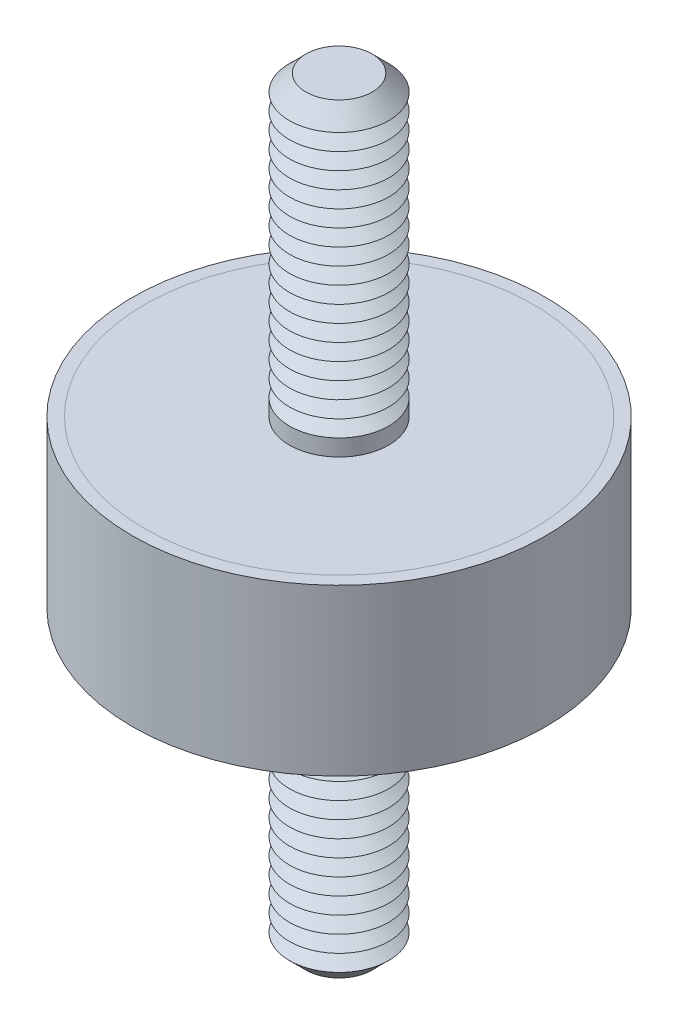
ISO-10303-21;
HEADER;
FILE_DESCRIPTION(('STEP AP214'),'2;1');
FILE_NAME('part.step','',(''),(''),'','','');
FILE_SCHEMA(('AUTOMOTIVE_DESIGN { 1 0 10303 214 1 1 1 1 }'));
ENDSEC;
DATA;
#1=APPLICATION_CONTEXT('core data for automotive mechanical design processes');
#2=APPLICATION_PROTOCOL_DEFINITION('international standard','automotive_design',2000,#1);
#3=PRODUCT_CONTEXT('',#1,'mechanical');
#4=PRODUCT('Part','Part','',(#3));
#5=PRODUCT_RELATED_PRODUCT_CATEGORY('part','',(#4));
#6=PRODUCT_DEFINITION_FORMATION('','',#4);
#7=PRODUCT_DEFINITION_CONTEXT('part definition',#1,'design');
#8=PRODUCT_DEFINITION('design','',#6,#7);
#9=PRODUCT_DEFINITION_SHAPE('','',#8);
#10=(LENGTH_UNIT() NAMED_UNIT(*) SI_UNIT(.MILLI.,.METRE.));
#11=(NAMED_UNIT(*) PLANE_ANGLE_UNIT() SI_UNIT($,.RADIAN.));
#12=(NAMED_UNIT(*) SI_UNIT($,.STERADIAN.) SOLID_ANGLE_UNIT());
#13=UNCERTAINTY_MEASURE_WITH_UNIT(LENGTH_MEASURE(1.E-05),#10,'distance_accuracy_value','');
#14=(GEOMETRIC_REPRESENTATION_CONTEXT(3) GLOBAL_UNCERTAINTY_ASSIGNED_CONTEXT((#13)) GLOBAL_UNIT_ASSIGNED_CONTEXT((#10,
#11,#12)) REPRESENTATION_CONTEXT('',''));
#15=CARTESIAN_POINT('',(0.,0.,0.));
#16=DIRECTION('',(0.,0.,1.));
#17=DIRECTION('',(1.,0.,0.));
#18=AXIS2_PLACEMENT_3D('',#15,#16,#17);
#19=CARTESIAN_POINT('',(0.,-23.,0.));
#20=DIRECTION('',(0.,1.,0.));
#21=DIRECTION('',(0.,0.,1.));
#22=AXIS2_PLACEMENT_3D('',#19,#20,#21);
#23=CYLINDRICAL_SURFACE('',#22,3.);
#24=CARTESIAN_POINT('',(0.,-5.,0.));
#25=DIRECTION('',(0.,-1.,0.));
#26=DIRECTION('',(0.,0.,-1.));
#27=AXIS2_PLACEMENT_3D('',#24,#25,#26);
#28=CIRCLE('',#27,3.);
#29=CARTESIAN_POINT('',(0.,-5.,-3.));
#30=VERTEX_POINT('',#29);
#31=EDGE_CURVE('P0_E21',#30,#30,#28,.T.);
#32=ORIENTED_EDGE('',*,*,#31,.T.);
#33=EDGE_LOOP('',(#32));
#34=FACE_BOUND('',#33,.T.);
#35=CARTESIAN_POINT('',(0.,-6.,0.));
#36=DIRECTION('',(0.,1.,0.));
#37=DIRECTION('',(0.,0.,1.));
#38=AXIS2_PLACEMENT_3D('',#35,#36,#37);
#39=CIRCLE('',#38,3.);
#40=CARTESIAN_POINT('',(0.,-6.,3.));
#41=VERTEX_POINT('',#40);
#42=EDGE_CURVE('P0_E33',#41,#41,#39,.T.);
#43=ORIENTED_EDGE('',*,*,#42,.T.);
#44=EDGE_LOOP('',(#43));
#45=FACE_BOUND('',#44,.T.);
#46=ADVANCED_FACE('P0_F14',(#34,#45),#23,.T.);
#47=CARTESIAN_POINT('',(0.,-5.,0.));
#48=DIRECTION('',(0.,1.,0.));
#49=DIRECTION('',(0.,0.,1.));
#50=AXIS2_PLACEMENT_3D('',#47,#48,#49);
#51=CYLINDRICAL_SURFACE('',#50,11.75);
#52=CARTESIAN_POINT('',(0.,-5.,0.));
#53=DIRECTION('',(0.,1.,0.));
#54=DIRECTION('',(0.,0.,1.));
#55=AXIS2_PLACEMENT_3D('',#52,#53,#54);
#56=CIRCLE('',#55,11.75);
#57=CARTESIAN_POINT('',(0.,-5.,11.75));
#58=VERTEX_POINT('',#57);
#59=EDGE_CURVE('P0_E25',#58,#58,#56,.T.);
#60=ORIENTED_EDGE('',*,*,#59,.T.);
#61=EDGE_LOOP('',(#60));
#62=FACE_BOUND('',#61,.T.);
#63=CARTESIAN_POINT('',(0.,-4.5,0.));
#64=DIRECTION('',(0.,1.,0.));
#65=DIRECTION('',(0.,0.,1.));
#66=AXIS2_PLACEMENT_3D('',#63,#64,#65);
#67=CIRCLE('',#66,11.75);
#68=CARTESIAN_POINT('',(0.,-4.5,11.75));
#69=VERTEX_POINT('',#68);
#70=EDGE_CURVE('P0_E30',#69,#69,#67,.T.);
#71=ORIENTED_EDGE('',*,*,#70,.F.);
#72=EDGE_LOOP('',(#71));
#73=FACE_BOUND('',#72,.T.);
#74=ADVANCED_FACE('P0_F157',(#62,#73),#51,.T.);
#75=CARTESIAN_POINT('',(0.,-5.,0.));
#76=DIRECTION('',(0.,1.,0.));
#77=DIRECTION('',(0.,0.,1.));
#78=AXIS2_PLACEMENT_3D('',#75,#76,#77);
#79=PLANE('',#78);
#80=ORIENTED_EDGE('',*,*,#31,.F.);
#81=EDGE_LOOP('',(#80));
#82=FACE_BOUND('',#81,.T.);
#83=ORIENTED_EDGE('',*,*,#59,.F.);
#84=EDGE_LOOP('',(#83));
#85=FACE_BOUND('',#84,.T.);
#86=ADVANCED_FACE('P0_F162',(#82,#85),#79,.F.);
#87=CARTESIAN_POINT('',(0.,-4.5,0.));
#88=DIRECTION('',(0.,1.,0.));
#89=DIRECTION('',(0.,0.,1.));
#90=AXIS2_PLACEMENT_3D('',#87,#88,#89);
#91=PLANE('',#90);
#92=ORIENTED_EDGE('',*,*,#70,.T.);
#93=EDGE_LOOP('',(#92));
#94=FACE_BOUND('',#93,.T.);
#95=ADVANCED_FACE('P0_F168',(#94),#91,.T.);
#96=CARTESIAN_POINT('',(0.,-6.,0.));
#97=DIRECTION('',(0.,1.,0.));
#98=DIRECTION('',(0.,0.,1.));
#99=AXIS2_PLACEMENT_3D('',#96,#97,#98);
#100=CONICAL_SURFACE('',#99,3.,1.0471975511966);
#101=CARTESIAN_POINT('',(0.,-6.5,0.));
#102=DIRECTION('',(0.,1.,0.));
#103=DIRECTION('',(0.,0.,1.));
#104=AXIS2_PLACEMENT_3D('',#101,#102,#103);
#105=CIRCLE('',#104,2.13397459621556);
#106=CARTESIAN_POINT('',(0.,-6.5,2.13397459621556));
#107=VERTEX_POINT('',#106);
#108=EDGE_CURVE('P0_E39',#107,#107,#105,.T.);
#109=ORIENTED_EDGE('',*,*,#108,.T.);
#110=EDGE_LOOP('',(#109));
#111=FACE_BOUND('',#110,.T.);
#112=ORIENTED_EDGE('',*,*,#42,.F.);
#113=EDGE_LOOP('',(#112));
#114=FACE_BOUND('',#113,.T.);
#115=ADVANCED_FACE('P0_F171',(#111,#114),#100,.T.);
#116=CARTESIAN_POINT('',(0.,-6.5,0.));
#117=DIRECTION('',(0.,-1.,0.));
#118=DIRECTION('',(0.,0.,-1.));
#119=AXIS2_PLACEMENT_3D('',#116,#117,#118);
#120=CONICAL_SURFACE('',#119,2.13397459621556,1.0471975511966);
#121=CARTESIAN_POINT('',(0.,-7.,0.));
#122=DIRECTION('',(0.,1.,0.));
#123=DIRECTION('',(0.,0.,1.));
#124=AXIS2_PLACEMENT_3D('',#121,#122,#123);
#125=CIRCLE('',#124,3.);
#126=CARTESIAN_POINT('',(0.,-7.,3.));
#127=VERTEX_POINT('',#126);
#128=EDGE_CURVE('P0_E43',#127,#127,#125,.T.);
#129=ORIENTED_EDGE('',*,*,#128,.T.);
#130=EDGE_LOOP('',(#129));
#131=FACE_BOUND('',#130,.T.);
#132=ORIENTED_EDGE('',*,*,#108,.F.);
#133=EDGE_LOOP('',(#132));
#134=FACE_BOUND('',#133,.T.);
#135=ADVANCED_FACE('P0_F175',(#131,#134),#120,.T.);
#136=CARTESIAN_POINT('',(0.,-7.,0.));
#137=DIRECTION('',(0.,1.,0.));
#138=DIRECTION('',(0.,0.,1.));
#139=AXIS2_PLACEMENT_3D('',#136,#137,#138);
#140=CONICAL_SURFACE('',#139,3.,1.0471975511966);
#141=CARTESIAN_POINT('',(0.,-7.5,0.));
#142=DIRECTION('',(0.,1.,0.));
#143=DIRECTION('',(0.,0.,1.));
#144=AXIS2_PLACEMENT_3D('',#141,#142,#143);
#145=CIRCLE('',#144,2.13397459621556);
#146=CARTESIAN_POINT('',(0.,-7.5,2.13397459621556));
#147=VERTEX_POINT('',#146);
#148=EDGE_CURVE('P0_E47',#147,#147,#145,.T.);
#149=ORIENTED_EDGE('',*,*,#148,.T.);
#150=EDGE_LOOP('',(#149));
#151=FACE_BOUND('',#150,.T.);
#152=ORIENTED_EDGE('',*,*,#128,.F.);
#153=EDGE_LOOP('',(#152));
#154=FACE_BOUND('',#153,.T.);
#155=ADVANCED_FACE('P0_F179',(#151,#154),#140,.T.);
#156=CARTESIAN_POINT('',(0.,-7.5,0.));
#157=DIRECTION('',(0.,-1.,0.));
#158=DIRECTION('',(0.,0.,-1.));
#159=AXIS2_PLACEMENT_3D('',#156,#157,#158);
#160=CONICAL_SURFACE('',#159,2.13397459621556,1.0471975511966);
#161=CARTESIAN_POINT('',(0.,-8.,0.));
#162=DIRECTION('',(0.,1.,0.));
#163=DIRECTION('',(0.,0.,1.));
#164=AXIS2_PLACEMENT_3D('',#161,#162,#163);
#165=CIRCLE('',#164,3.);
#166=CARTESIAN_POINT('',(0.,-8.,3.));
#167=VERTEX_POINT('',#166);
#168=EDGE_CURVE('P0_E52',#167,#167,#165,.T.);
#169=ORIENTED_EDGE('',*,*,#168,.T.);
#170=EDGE_LOOP('',(#169));
#171=FACE_BOUND('',#170,.T.);
#172=ORIENTED_EDGE('',*,*,#148,.F.);
#173=EDGE_LOOP('',(#172));
#174=FACE_BOUND('',#173,.T.);
#175=ADVANCED_FACE('P0_F186',(#171,#174),#160,.T.);
#176=CARTESIAN_POINT('',(0.,-8.,0.));
#177=DIRECTION('',(0.,1.,0.));
#178=DIRECTION('',(0.,0.,1.));
#179=AXIS2_PLACEMENT_3D('',#176,#177,#178);
#180=CONICAL_SURFACE('',#179,3.,1.0471975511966);
#181=CARTESIAN_POINT('',(0.,-8.5,0.));
#182=DIRECTION('',(0.,1.,0.));
#183=DIRECTION('',(0.,0.,1.));
#184=AXIS2_PLACEMENT_3D('',#181,#182,#183);
#185=CIRCLE('',#184,2.13397459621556);
#186=CARTESIAN_POINT('',(0.,-8.5,2.13397459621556));
#187=VERTEX_POINT('',#186);
#188=EDGE_CURVE('P0_E55',#187,#187,#185,.T.);
#189=ORIENTED_EDGE('',*,*,#188,.T.);
#190=EDGE_LOOP('',(#189));
#191=FACE_BOUND('',#190,.T.);
#192=ORIENTED_EDGE('',*,*,#168,.F.);
#193=EDGE_LOOP('',(#192));
#194=FACE_BOUND('',#193,.T.);
#195=ADVANCED_FACE('P0_F190',(#191,#194),#180,.T.);
#196=CARTESIAN_POINT('',(0.,-8.5,0.));
#197=DIRECTION('',(0.,-1.,0.));
#198=DIRECTION('',(0.,0.,-1.));
#199=AXIS2_PLACEMENT_3D('',#196,#197,#198);
#200=CONICAL_SURFACE('',#199,2.13397459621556,1.0471975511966);
#201=CARTESIAN_POINT('',(0.,-9.,0.));
#202=DIRECTION('',(0.,1.,0.));
#203=DIRECTION('',(0.,0.,1.));
#204=AXIS2_PLACEMENT_3D('',#201,#202,#203);
#205=CIRCLE('',#204,3.);
#206=CARTESIAN_POINT('',(0.,-9.,3.));
#207=VERTEX_POINT('',#206);
#208=EDGE_CURVE('P0_E58',#207,#207,#205,.T.);
#209=ORIENTED_EDGE('',*,*,#208,.T.);
#210=EDGE_LOOP('',(#209));
#211=FACE_BOUND('',#210,.T.);
#212=ORIENTED_EDGE('',*,*,#188,.F.);
#213=EDGE_LOOP('',(#212));
#214=FACE_BOUND('',#213,.T.);
#215=ADVANCED_FACE('P0_F194',(#211,#214),#200,.T.);
#216=CARTESIAN_POINT('',(0.,-9.,0.));
#217=DIRECTION('',(0.,1.,0.));
#218=DIRECTION('',(0.,0.,1.));
#219=AXIS2_PLACEMENT_3D('',#216,#217,#218);
#220=CONICAL_SURFACE('',#219,3.,1.0471975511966);
#221=CARTESIAN_POINT('',(0.,-9.5,0.));
#222=DIRECTION('',(0.,1.,0.));
#223=DIRECTION('',(0.,0.,1.));
#224=AXIS2_PLACEMENT_3D('',#221,#222,#223);
#225=CIRCLE('',#224,2.13397459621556);
#226=CARTESIAN_POINT('',(0.,-9.5,2.13397459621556));
#227=VERTEX_POINT('',#226);
#228=EDGE_CURVE('P0_E61',#227,#227,#225,.T.);
#229=ORIENTED_EDGE('',*,*,#228,.T.);
#230=EDGE_LOOP('',(#229));
#231=FACE_BOUND('',#230,.T.);
#232=ORIENTED_EDGE('',*,*,#208,.F.);
#233=EDGE_LOOP('',(#232));
#234=FACE_BOUND('',#233,.T.);
#235=ADVANCED_FACE('P0_F198',(#231,#234),#220,.T.);
#236=CARTESIAN_POINT('',(0.,-9.5,0.));
#237=DIRECTION('',(0.,-1.,0.));
#238=DIRECTION('',(0.,0.,-1.));
#239=AXIS2_PLACEMENT_3D('',#236,#237,#238);
#240=CONICAL_SURFACE('',#239,2.13397459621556,1.0471975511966);
#241=CARTESIAN_POINT('',(0.,-10.,0.));
#242=DIRECTION('',(0.,1.,0.));
#243=DIRECTION('',(0.,0.,1.));
#244=AXIS2_PLACEMENT_3D('',#241,#242,#243);
#245=CIRCLE('',#244,3.);
#246=CARTESIAN_POINT('',(0.,-10.,3.));
#247=VERTEX_POINT('',#246);
#248=EDGE_CURVE('P0_E64',#247,#247,#245,.T.);
#249=ORIENTED_EDGE('',*,*,#248,.T.);
#250=EDGE_LOOP('',(#249));
#251=FACE_BOUND('',#250,.T.);
#252=ORIENTED_EDGE('',*,*,#228,.F.);
#253=EDGE_LOOP('',(#252));
#254=FACE_BOUND('',#253,.T.);
#255=ADVANCED_FACE('P0_F202',(#251,#254),#240,.T.);
#256=CARTESIAN_POINT('',(0.,-10.,0.));
#257=DIRECTION('',(0.,1.,0.));
#258=DIRECTION('',(0.,0.,1.));
#259=AXIS2_PLACEMENT_3D('',#256,#257,#258);
#260=CONICAL_SURFACE('',#259,3.,1.0471975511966);
#261=CARTESIAN_POINT('',(0.,-10.5,0.));
#262=DIRECTION('',(0.,1.,0.));
#263=DIRECTION('',(0.,0.,1.));
#264=AXIS2_PLACEMENT_3D('',#261,#262,#263);
#265=CIRCLE('',#264,2.13397459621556);
#266=CARTESIAN_POINT('',(0.,-10.5,2.13397459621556));
#267=VERTEX_POINT('',#266);
#268=EDGE_CURVE('P0_E67',#267,#267,#265,.T.);
#269=ORIENTED_EDGE('',*,*,#268,.T.);
#270=EDGE_LOOP('',(#269));
#271=FACE_BOUND('',#270,.T.);
#272=ORIENTED_EDGE('',*,*,#248,.F.);
#273=EDGE_LOOP('',(#272));
#274=FACE_BOUND('',#273,.T.);
#275=ADVANCED_FACE('P0_F206',(#271,#274),#260,.T.);
#276=CARTESIAN_POINT('',(0.,-10.5,0.));
#277=DIRECTION('',(0.,-1.,0.));
#278=DIRECTION('',(0.,0.,-1.));
#279=AXIS2_PLACEMENT_3D('',#276,#277,#278);
#280=CONICAL_SURFACE('',#279,2.13397459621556,1.0471975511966);
#281=CARTESIAN_POINT('',(0.,-11.,0.));
#282=DIRECTION('',(0.,1.,0.));
#283=DIRECTION('',(0.,0.,1.));
#284=AXIS2_PLACEMENT_3D('',#281,#282,#283);
#285=CIRCLE('',#284,3.);
#286=CARTESIAN_POINT('',(0.,-11.,3.));
#287=VERTEX_POINT('',#286);
#288=EDGE_CURVE('P0_E70',#287,#287,#285,.T.);
#289=ORIENTED_EDGE('',*,*,#288,.T.);
#290=EDGE_LOOP('',(#289));
#291=FACE_BOUND('',#290,.T.);
#292=ORIENTED_EDGE('',*,*,#268,.F.);
#293=EDGE_LOOP('',(#292));
#294=FACE_BOUND('',#293,.T.);
#295=ADVANCED_FACE('P0_F210',(#291,#294),#280,.T.);
#296=CARTESIAN_POINT('',(0.,-11.,0.));
#297=DIRECTION('',(0.,1.,0.));
#298=DIRECTION('',(0.,0.,1.));
#299=AXIS2_PLACEMENT_3D('',#296,#297,#298);
#300=CONICAL_SURFACE('',#299,3.,1.0471975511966);
#301=CARTESIAN_POINT('',(0.,-11.5,0.));
#302=DIRECTION('',(0.,1.,0.));
#303=DIRECTION('',(0.,0.,1.));
#304=AXIS2_PLACEMENT_3D('',#301,#302,#303);
#305=CIRCLE('',#304,2.13397459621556);
#306=CARTESIAN_POINT('',(0.,-11.5,2.13397459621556));
#307=VERTEX_POINT('',#306);
#308=EDGE_CURVE('P0_E73',#307,#307,#305,.T.);
#309=ORIENTED_EDGE('',*,*,#308,.T.);
#310=EDGE_LOOP('',(#309));
#311=FACE_BOUND('',#310,.T.);
#312=ORIENTED_EDGE('',*,*,#288,.F.);
#313=EDGE_LOOP('',(#312));
#314=FACE_BOUND('',#313,.T.);
#315=ADVANCED_FACE('P0_F214',(#311,#314),#300,.T.);
#316=CARTESIAN_POINT('',(0.,-11.5,0.));
#317=DIRECTION('',(0.,-1.,0.));
#318=DIRECTION('',(0.,0.,-1.));
#319=AXIS2_PLACEMENT_3D('',#316,#317,#318);
#320=CONICAL_SURFACE('',#319,2.13397459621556,1.0471975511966);
#321=CARTESIAN_POINT('',(0.,-12.,0.));
#322=DIRECTION('',(0.,1.,0.));
#323=DIRECTION('',(0.,0.,1.));
#324=AXIS2_PLACEMENT_3D('',#321,#322,#323);
#325=CIRCLE('',#324,3.);
#326=CARTESIAN_POINT('',(0.,-12.,3.));
#327=VERTEX_POINT('',#326);
#328=EDGE_CURVE('P0_E76',#327,#327,#325,.T.);
#329=ORIENTED_EDGE('',*,*,#328,.T.);
#330=EDGE_LOOP('',(#329));
#331=FACE_BOUND('',#330,.T.);
#332=ORIENTED_EDGE('',*,*,#308,.F.);
#333=EDGE_LOOP('',(#332));
#334=FACE_BOUND('',#333,.T.);
#335=ADVANCED_FACE('P0_F218',(#331,#334),#320,.T.);
#336=CARTESIAN_POINT('',(0.,-12.,0.));
#337=DIRECTION('',(0.,1.,0.));
#338=DIRECTION('',(0.,0.,1.));
#339=AXIS2_PLACEMENT_3D('',#336,#337,#338);
#340=CONICAL_SURFACE('',#339,3.,1.0471975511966);
#341=CARTESIAN_POINT('',(0.,-12.5,0.));
#342=DIRECTION('',(0.,1.,0.));
#343=DIRECTION('',(0.,0.,1.));
#344=AXIS2_PLACEMENT_3D('',#341,#342,#343);
#345=CIRCLE('',#344,2.13397459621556);
#346=CARTESIAN_POINT('',(0.,-12.5,2.13397459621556));
#347=VERTEX_POINT('',#346);
#348=EDGE_CURVE('P0_E79',#347,#347,#345,.T.);
#349=ORIENTED_EDGE('',*,*,#348,.T.);
#350=EDGE_LOOP('',(#349));
#351=FACE_BOUND('',#350,.T.);
#352=ORIENTED_EDGE('',*,*,#328,.F.);
#353=EDGE_LOOP('',(#352));
#354=FACE_BOUND('',#353,.T.);
#355=ADVANCED_FACE('P0_F222',(#351,#354),#340,.T.);
#356=CARTESIAN_POINT('',(0.,-12.5,0.));
#357=DIRECTION('',(0.,-1.,0.));
#358=DIRECTION('',(0.,0.,-1.));
#359=AXIS2_PLACEMENT_3D('',#356,#357,#358);
#360=CONICAL_SURFACE('',#359,2.13397459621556,1.0471975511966);
#361=CARTESIAN_POINT('',(0.,-13.,0.));
#362=DIRECTION('',(0.,1.,0.));
#363=DIRECTION('',(0.,0.,1.));
#364=AXIS2_PLACEMENT_3D('',#361,#362,#363);
#365=CIRCLE('',#364,3.);
#366=CARTESIAN_POINT('',(0.,-13.,3.));
#367=VERTEX_POINT('',#366);
#368=EDGE_CURVE('P0_E82',#367,#367,#365,.T.);
#369=ORIENTED_EDGE('',*,*,#368,.T.);
#370=EDGE_LOOP('',(#369));
#371=FACE_BOUND('',#370,.T.);
#372=ORIENTED_EDGE('',*,*,#348,.F.);
#373=EDGE_LOOP('',(#372));
#374=FACE_BOUND('',#373,.T.);
#375=ADVANCED_FACE('P0_F226',(#371,#374),#360,.T.);
#376=CARTESIAN_POINT('',(0.,-13.,0.));
#377=DIRECTION('',(0.,1.,0.));
#378=DIRECTION('',(0.,0.,1.));
#379=AXIS2_PLACEMENT_3D('',#376,#377,#378);
#380=CONICAL_SURFACE('',#379,3.,1.0471975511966);
#381=CARTESIAN_POINT('',(0.,-13.5,0.));
#382=DIRECTION('',(0.,1.,0.));
#383=DIRECTION('',(0.,0.,1.));
#384=AXIS2_PLACEMENT_3D('',#381,#382,#383);
#385=CIRCLE('',#384,2.13397459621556);
#386=CARTESIAN_POINT('',(0.,-13.5,2.13397459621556));
#387=VERTEX_POINT('',#386);
#388=EDGE_CURVE('P0_E85',#387,#387,#385,.T.);
#389=ORIENTED_EDGE('',*,*,#388,.T.);
#390=EDGE_LOOP('',(#389));
#391=FACE_BOUND('',#390,.T.);
#392=ORIENTED_EDGE('',*,*,#368,.F.);
#393=EDGE_LOOP('',(#392));
#394=FACE_BOUND('',#393,.T.);
#395=ADVANCED_FACE('P0_F230',(#391,#394),#380,.T.);
#396=CARTESIAN_POINT('',(0.,-13.5,0.));
#397=DIRECTION('',(0.,-1.,0.));
#398=DIRECTION('',(0.,0.,-1.));
#399=AXIS2_PLACEMENT_3D('',#396,#397,#398);
#400=CONICAL_SURFACE('',#399,2.13397459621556,1.0471975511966);
#401=CARTESIAN_POINT('',(0.,-14.,0.));
#402=DIRECTION('',(0.,1.,0.));
#403=DIRECTION('',(0.,0.,1.));
#404=AXIS2_PLACEMENT_3D('',#401,#402,#403);
#405=CIRCLE('',#404,3.);
#406=CARTESIAN_POINT('',(0.,-14.,3.));
#407=VERTEX_POINT('',#406);
#408=EDGE_CURVE('P0_E88',#407,#407,#405,.T.);
#409=ORIENTED_EDGE('',*,*,#408,.T.);
#410=EDGE_LOOP('',(#409));
#411=FACE_BOUND('',#410,.T.);
#412=ORIENTED_EDGE('',*,*,#388,.F.);
#413=EDGE_LOOP('',(#412));
#414=FACE_BOUND('',#413,.T.);
#415=ADVANCED_FACE('P0_F234',(#411,#414),#400,.T.);
#416=CARTESIAN_POINT('',(0.,-14.,0.));
#417=DIRECTION('',(0.,1.,0.));
#418=DIRECTION('',(0.,0.,1.));
#419=AXIS2_PLACEMENT_3D('',#416,#417,#418);
#420=CONICAL_SURFACE('',#419,3.,1.0471975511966);
#421=CARTESIAN_POINT('',(0.,-14.5,0.));
#422=DIRECTION('',(0.,1.,0.));
#423=DIRECTION('',(0.,0.,1.));
#424=AXIS2_PLACEMENT_3D('',#421,#422,#423);
#425=CIRCLE('',#424,2.13397459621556);
#426=CARTESIAN_POINT('',(0.,-14.5,2.13397459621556));
#427=VERTEX_POINT('',#426);
#428=EDGE_CURVE('P0_E91',#427,#427,#425,.T.);
#429=ORIENTED_EDGE('',*,*,#428,.T.);
#430=EDGE_LOOP('',(#429));
#431=FACE_BOUND('',#430,.T.);
#432=ORIENTED_EDGE('',*,*,#408,.F.);
#433=EDGE_LOOP('',(#432));
#434=FACE_BOUND('',#433,.T.);
#435=ADVANCED_FACE('P0_F238',(#431,#434),#420,.T.);
#436=CARTESIAN_POINT('',(0.,-14.5,0.));
#437=DIRECTION('',(0.,-1.,0.));
#438=DIRECTION('',(0.,0.,-1.));
#439=AXIS2_PLACEMENT_3D('',#436,#437,#438);
#440=CONICAL_SURFACE('',#439,2.13397459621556,1.0471975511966);
#441=CARTESIAN_POINT('',(0.,-15.,0.));
#442=DIRECTION('',(0.,1.,0.));
#443=DIRECTION('',(0.,0.,1.));
#444=AXIS2_PLACEMENT_3D('',#441,#442,#443);
#445=CIRCLE('',#444,3.);
#446=CARTESIAN_POINT('',(0.,-15.,3.));
#447=VERTEX_POINT('',#446);
#448=EDGE_CURVE('P0_E94',#447,#447,#445,.T.);
#449=ORIENTED_EDGE('',*,*,#448,.T.);
#450=EDGE_LOOP('',(#449));
#451=FACE_BOUND('',#450,.T.);
#452=ORIENTED_EDGE('',*,*,#428,.F.);
#453=EDGE_LOOP('',(#452));
#454=FACE_BOUND('',#453,.T.);
#455=ADVANCED_FACE('P0_F242',(#451,#454),#440,.T.);
#456=CARTESIAN_POINT('',(0.,-15.,0.));
#457=DIRECTION('',(0.,1.,0.));
#458=DIRECTION('',(0.,0.,1.));
#459=AXIS2_PLACEMENT_3D('',#456,#457,#458);
#460=CONICAL_SURFACE('',#459,3.,1.0471975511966);
#461=CARTESIAN_POINT('',(0.,-15.5,0.));
#462=DIRECTION('',(0.,1.,0.));
#463=DIRECTION('',(0.,0.,1.));
#464=AXIS2_PLACEMENT_3D('',#461,#462,#463);
#465=CIRCLE('',#464,2.13397459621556);
#466=CARTESIAN_POINT('',(0.,-15.5,2.13397459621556));
#467=VERTEX_POINT('',#466);
#468=EDGE_CURVE('P0_E97',#467,#467,#465,.T.);
#469=ORIENTED_EDGE('',*,*,#468,.T.);
#470=EDGE_LOOP('',(#469));
#471=FACE_BOUND('',#470,.T.);
#472=ORIENTED_EDGE('',*,*,#448,.F.);
#473=EDGE_LOOP('',(#472));
#474=FACE_BOUND('',#473,.T.);
#475=ADVANCED_FACE('P0_F246',(#471,#474),#460,.T.);
#476=CARTESIAN_POINT('',(0.,-15.5,0.));
#477=DIRECTION('',(0.,-1.,0.));
#478=DIRECTION('',(0.,0.,-1.));
#479=AXIS2_PLACEMENT_3D('',#476,#477,#478);
#480=CONICAL_SURFACE('',#479,2.13397459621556,1.0471975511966);
#481=CARTESIAN_POINT('',(0.,-16.,0.));
#482=DIRECTION('',(0.,1.,0.));
#483=DIRECTION('',(0.,0.,1.));
#484=AXIS2_PLACEMENT_3D('',#481,#482,#483);
#485=CIRCLE('',#484,3.);
#486=CARTESIAN_POINT('',(0.,-16.,3.));
#487=VERTEX_POINT('',#486);
#488=EDGE_CURVE('P0_E100',#487,#487,#485,.T.);
#489=ORIENTED_EDGE('',*,*,#488,.T.);
#490=EDGE_LOOP('',(#489));
#491=FACE_BOUND('',#490,.T.);
#492=ORIENTED_EDGE('',*,*,#468,.F.);
#493=EDGE_LOOP('',(#492));
#494=FACE_BOUND('',#493,.T.);
#495=ADVANCED_FACE('P0_F250',(#491,#494),#480,.T.);
#496=CARTESIAN_POINT('',(0.,-16.,0.));
#497=DIRECTION('',(0.,1.,0.));
#498=DIRECTION('',(0.,0.,1.));
#499=AXIS2_PLACEMENT_3D('',#496,#497,#498);
#500=CONICAL_SURFACE('',#499,3.,1.0471975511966);
#501=CARTESIAN_POINT('',(0.,-16.5,0.));
#502=DIRECTION('',(0.,1.,0.));
#503=DIRECTION('',(0.,0.,1.));
#504=AXIS2_PLACEMENT_3D('',#501,#502,#503);
#505=CIRCLE('',#504,2.13397459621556);
#506=CARTESIAN_POINT('',(0.,-16.5,2.13397459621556));
#507=VERTEX_POINT('',#506);
#508=EDGE_CURVE('P0_E103',#507,#507,#505,.T.);
#509=ORIENTED_EDGE('',*,*,#508,.T.);
#510=EDGE_LOOP('',(#509));
#511=FACE_BOUND('',#510,.T.);
#512=ORIENTED_EDGE('',*,*,#488,.F.);
#513=EDGE_LOOP('',(#512));
#514=FACE_BOUND('',#513,.T.);
#515=ADVANCED_FACE('P0_F254',(#511,#514),#500,.T.);
#516=CARTESIAN_POINT('',(0.,-16.5,0.));
#517=DIRECTION('',(0.,-1.,0.));
#518=DIRECTION('',(0.,0.,-1.));
#519=AXIS2_PLACEMENT_3D('',#516,#517,#518);
#520=CONICAL_SURFACE('',#519,2.13397459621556,1.0471975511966);
#521=CARTESIAN_POINT('',(0.,-17.,0.));
#522=DIRECTION('',(0.,1.,0.));
#523=DIRECTION('',(0.,0.,1.));
#524=AXIS2_PLACEMENT_3D('',#521,#522,#523);
#525=CIRCLE('',#524,3.);
#526=CARTESIAN_POINT('',(0.,-17.,3.));
#527=VERTEX_POINT('',#526);
#528=EDGE_CURVE('P0_E106',#527,#527,#525,.T.);
#529=ORIENTED_EDGE('',*,*,#528,.T.);
#530=EDGE_LOOP('',(#529));
#531=FACE_BOUND('',#530,.T.);
#532=ORIENTED_EDGE('',*,*,#508,.F.);
#533=EDGE_LOOP('',(#532));
#534=FACE_BOUND('',#533,.T.);
#535=ADVANCED_FACE('P0_F258',(#531,#534),#520,.T.);
#536=CARTESIAN_POINT('',(0.,-17.,0.));
#537=DIRECTION('',(0.,1.,0.));
#538=DIRECTION('',(0.,0.,1.));
#539=AXIS2_PLACEMENT_3D('',#536,#537,#538);
#540=CONICAL_SURFACE('',#539,3.,1.0471975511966);
#541=CARTESIAN_POINT('',(0.,-17.5,0.));
#542=DIRECTION('',(0.,1.,0.));
#543=DIRECTION('',(0.,0.,1.));
#544=AXIS2_PLACEMENT_3D('',#541,#542,#543);
#545=CIRCLE('',#544,2.13397459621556);
#546=CARTESIAN_POINT('',(0.,-17.5,2.13397459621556));
#547=VERTEX_POINT('',#546);
#548=EDGE_CURVE('P0_E109',#547,#547,#545,.T.);
#549=ORIENTED_EDGE('',*,*,#548,.T.);
#550=EDGE_LOOP('',(#549));
#551=FACE_BOUND('',#550,.T.);
#552=ORIENTED_EDGE('',*,*,#528,.F.);
#553=EDGE_LOOP('',(#552));
#554=FACE_BOUND('',#553,.T.);
#555=ADVANCED_FACE('P0_F262',(#551,#554),#540,.T.);
#556=CARTESIAN_POINT('',(0.,-17.5,0.));
#557=DIRECTION('',(0.,-1.,0.));
#558=DIRECTION('',(0.,0.,-1.));
#559=AXIS2_PLACEMENT_3D('',#556,#557,#558);
#560=CONICAL_SURFACE('',#559,2.13397459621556,1.0471975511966);
#561=CARTESIAN_POINT('',(0.,-18.,0.));
#562=DIRECTION('',(0.,1.,0.));
#563=DIRECTION('',(0.,0.,1.));
#564=AXIS2_PLACEMENT_3D('',#561,#562,#563);
#565=CIRCLE('',#564,3.);
#566=CARTESIAN_POINT('',(0.,-18.,3.));
#567=VERTEX_POINT('',#566);
#568=EDGE_CURVE('P0_E112',#567,#567,#565,.T.);
#569=ORIENTED_EDGE('',*,*,#568,.T.);
#570=EDGE_LOOP('',(#569));
#571=FACE_BOUND('',#570,.T.);
#572=ORIENTED_EDGE('',*,*,#548,.F.);
#573=EDGE_LOOP('',(#572));
#574=FACE_BOUND('',#573,.T.);
#575=ADVANCED_FACE('P0_F266',(#571,#574),#560,.T.);
#576=CARTESIAN_POINT('',(0.,-18.,0.));
#577=DIRECTION('',(0.,1.,0.));
#578=DIRECTION('',(0.,0.,1.));
#579=AXIS2_PLACEMENT_3D('',#576,#577,#578);
#580=CONICAL_SURFACE('',#579,3.,1.0471975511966);
#581=CARTESIAN_POINT('',(0.,-18.5,0.));
#582=DIRECTION('',(0.,1.,0.));
#583=DIRECTION('',(0.,0.,1.));
#584=AXIS2_PLACEMENT_3D('',#581,#582,#583);
#585=CIRCLE('',#584,2.13397459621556);
#586=CARTESIAN_POINT('',(0.,-18.5,2.13397459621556));
#587=VERTEX_POINT('',#586);
#588=EDGE_CURVE('P0_E115',#587,#587,#585,.T.);
#589=ORIENTED_EDGE('',*,*,#588,.T.);
#590=EDGE_LOOP('',(#589));
#591=FACE_BOUND('',#590,.T.);
#592=ORIENTED_EDGE('',*,*,#568,.F.);
#593=EDGE_LOOP('',(#592));
#594=FACE_BOUND('',#593,.T.);
#595=ADVANCED_FACE('P0_F270',(#591,#594),#580,.T.);
#596=CARTESIAN_POINT('',(0.,-18.5,0.));
#597=DIRECTION('',(0.,-1.,0.));
#598=DIRECTION('',(0.,0.,-1.));
#599=AXIS2_PLACEMENT_3D('',#596,#597,#598);
#600=CONICAL_SURFACE('',#599,2.13397459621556,1.0471975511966);
#601=CARTESIAN_POINT('',(0.,-19.,0.));
#602=DIRECTION('',(0.,1.,0.));
#603=DIRECTION('',(0.,0.,1.));
#604=AXIS2_PLACEMENT_3D('',#601,#602,#603);
#605=CIRCLE('',#604,3.);
#606=CARTESIAN_POINT('',(0.,-19.,3.));
#607=VERTEX_POINT('',#606);
#608=EDGE_CURVE('P0_E118',#607,#607,#605,.T.);
#609=ORIENTED_EDGE('',*,*,#608,.T.);
#610=EDGE_LOOP('',(#609));
#611=FACE_BOUND('',#610,.T.);
#612=ORIENTED_EDGE('',*,*,#588,.F.);
#613=EDGE_LOOP('',(#612));
#614=FACE_BOUND('',#613,.T.);
#615=ADVANCED_FACE('P0_F274',(#611,#614),#600,.T.);
#616=CARTESIAN_POINT('',(0.,-19.,0.));
#617=DIRECTION('',(0.,1.,0.));
#618=DIRECTION('',(0.,0.,1.));
#619=AXIS2_PLACEMENT_3D('',#616,#617,#618);
#620=CONICAL_SURFACE('',#619,3.,1.0471975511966);
#621=CARTESIAN_POINT('',(0.,-19.5,0.));
#622=DIRECTION('',(0.,1.,0.));
#623=DIRECTION('',(0.,0.,1.));
#624=AXIS2_PLACEMENT_3D('',#621,#622,#623);
#625=CIRCLE('',#624,2.13397459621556);
#626=CARTESIAN_POINT('',(0.,-19.5,2.13397459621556));
#627=VERTEX_POINT('',#626);
#628=EDGE_CURVE('P0_E121',#627,#627,#625,.T.);
#629=ORIENTED_EDGE('',*,*,#628,.T.);
#630=EDGE_LOOP('',(#629));
#631=FACE_BOUND('',#630,.T.);
#632=ORIENTED_EDGE('',*,*,#608,.F.);
#633=EDGE_LOOP('',(#632));
#634=FACE_BOUND('',#633,.T.);
#635=ADVANCED_FACE('P0_F278',(#631,#634),#620,.T.);
#636=CARTESIAN_POINT('',(0.,-19.5,0.));
#637=DIRECTION('',(0.,-1.,0.));
#638=DIRECTION('',(0.,0.,-1.));
#639=AXIS2_PLACEMENT_3D('',#636,#637,#638);
#640=CONICAL_SURFACE('',#639,2.13397459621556,1.0471975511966);
#641=CARTESIAN_POINT('',(0.,-20.,0.));
#642=DIRECTION('',(0.,1.,0.));
#643=DIRECTION('',(0.,0.,1.));
#644=AXIS2_PLACEMENT_3D('',#641,#642,#643);
#645=CIRCLE('',#644,3.);
#646=CARTESIAN_POINT('',(0.,-20.,3.));
#647=VERTEX_POINT('',#646);
#648=EDGE_CURVE('P0_E124',#647,#647,#645,.T.);
#649=ORIENTED_EDGE('',*,*,#648,.T.);
#650=EDGE_LOOP('',(#649));
#651=FACE_BOUND('',#650,.T.);
#652=ORIENTED_EDGE('',*,*,#628,.F.);
#653=EDGE_LOOP('',(#652));
#654=FACE_BOUND('',#653,.T.);
#655=ADVANCED_FACE('P0_F282',(#651,#654),#640,.T.);
#656=CARTESIAN_POINT('',(0.,-20.,0.));
#657=DIRECTION('',(0.,1.,0.));
#658=DIRECTION('',(0.,0.,1.));
#659=AXIS2_PLACEMENT_3D('',#656,#657,#658);
#660=CONICAL_SURFACE('',#659,3.,1.0471975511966);
#661=CARTESIAN_POINT('',(0.,-20.5,0.));
#662=DIRECTION('',(0.,1.,0.));
#663=DIRECTION('',(0.,0.,1.));
#664=AXIS2_PLACEMENT_3D('',#661,#662,#663);
#665=CIRCLE('',#664,2.13397459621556);
#666=CARTESIAN_POINT('',(0.,-20.5,2.13397459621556));
#667=VERTEX_POINT('',#666);
#668=EDGE_CURVE('P0_E127',#667,#667,#665,.T.);
#669=ORIENTED_EDGE('',*,*,#668,.T.);
#670=EDGE_LOOP('',(#669));
#671=FACE_BOUND('',#670,.T.);
#672=ORIENTED_EDGE('',*,*,#648,.F.);
#673=EDGE_LOOP('',(#672));
#674=FACE_BOUND('',#673,.T.);
#675=ADVANCED_FACE('P0_F286',(#671,#674),#660,.T.);
#676=CARTESIAN_POINT('',(0.,-20.5,0.));
#677=DIRECTION('',(0.,-1.,0.));
#678=DIRECTION('',(0.,0.,-1.));
#679=AXIS2_PLACEMENT_3D('',#676,#677,#678);
#680=CONICAL_SURFACE('',#679,2.13397459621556,1.0471975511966);
#681=CARTESIAN_POINT('',(0.,-21.,0.));
#682=DIRECTION('',(0.,1.,0.));
#683=DIRECTION('',(0.,0.,1.));
#684=AXIS2_PLACEMENT_3D('',#681,#682,#683);
#685=CIRCLE('',#684,3.);
#686=CARTESIAN_POINT('',(0.,-21.,3.));
#687=VERTEX_POINT('',#686);
#688=EDGE_CURVE('P0_E130',#687,#687,#685,.T.);
#689=ORIENTED_EDGE('',*,*,#688,.T.);
#690=EDGE_LOOP('',(#689));
#691=FACE_BOUND('',#690,.T.);
#692=ORIENTED_EDGE('',*,*,#668,.F.);
#693=EDGE_LOOP('',(#692));
#694=FACE_BOUND('',#693,.T.);
#695=ADVANCED_FACE('P0_F154',(#691,#694),#680,.T.);
#696=CARTESIAN_POINT('',(0.,-21.,0.));
#697=DIRECTION('',(0.,1.,0.));
#698=DIRECTION('',(0.,0.,1.));
#699=AXIS2_PLACEMENT_3D('',#696,#697,#698);
#700=CONICAL_SURFACE('',#699,3.,1.0471975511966);
#701=CARTESIAN_POINT('',(0.,-21.5,0.));
#702=DIRECTION('',(0.,1.,0.));
#703=DIRECTION('',(0.,0.,1.));
#704=AXIS2_PLACEMENT_3D('',#701,#702,#703);
#705=CIRCLE('',#704,2.13397459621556);
#706=CARTESIAN_POINT('',(0.,-21.5,2.13397459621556));
#707=VERTEX_POINT('',#706);
#708=EDGE_CURVE('P0_E136',#707,#707,#705,.T.);
#709=ORIENTED_EDGE('',*,*,#708,.T.);
#710=EDGE_LOOP('',(#709));
#711=FACE_BOUND('',#710,.T.);
#712=ORIENTED_EDGE('',*,*,#688,.F.);
#713=EDGE_LOOP('',(#712));
#714=FACE_BOUND('',#713,.T.);
#715=ADVANCED_FACE('P0_F140',(#711,#714),#700,.T.);
#716=CARTESIAN_POINT('',(0.,-21.5,0.));
#717=DIRECTION('',(0.,-1.,0.));
#718=DIRECTION('',(0.,0.,-1.));
#719=AXIS2_PLACEMENT_3D('',#716,#717,#718);
#720=CONICAL_SURFACE('',#719,2.13397459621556,1.0471975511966);
#721=CARTESIAN_POINT('',(0.,-22.,0.));
#722=DIRECTION('',(0.,1.,0.));
#723=DIRECTION('',(0.,0.,1.));
#724=AXIS2_PLACEMENT_3D('',#721,#722,#723);
#725=CIRCLE('',#724,3.);
#726=CARTESIAN_POINT('',(0.,-22.,3.));
#727=VERTEX_POINT('',#726);
#728=EDGE_CURVE('P0_E133',#727,#727,#725,.T.);
#729=ORIENTED_EDGE('',*,*,#728,.T.);
#730=EDGE_LOOP('',(#729));
#731=FACE_BOUND('',#730,.T.);
#732=ORIENTED_EDGE('',*,*,#708,.F.);
#733=EDGE_LOOP('',(#732));
#734=FACE_BOUND('',#733,.T.);
#735=ADVANCED_FACE('P0_F143',(#731,#734),#720,.T.);
#736=CARTESIAN_POINT('',(0.,-23.,0.));
#737=DIRECTION('',(0.,-1.,0.));
#738=DIRECTION('',(0.,0.,-1.));
#739=AXIS2_PLACEMENT_3D('',#736,#737,#738);
#740=PLANE('',#739);
#741=CARTESIAN_POINT('',(0.,-23.,0.));
#742=DIRECTION('',(0.,-1.,0.));
#743=DIRECTION('',(0.,0.,-1.));
#744=AXIS2_PLACEMENT_3D('',#741,#742,#743);
#745=CIRCLE('',#744,1.99999999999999);
#746=CARTESIAN_POINT('',(0.,-23.,-1.99999999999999));
#747=VERTEX_POINT('',#746);
#748=EDGE_CURVE('P0_E10',#747,#747,#745,.T.);
#749=ORIENTED_EDGE('',*,*,#748,.T.);
#750=EDGE_LOOP('',(#749));
#751=FACE_BOUND('',#750,.T.);
#752=ADVANCED_FACE('P0_F145',(#751),#740,.T.);
#753=CARTESIAN_POINT('',(0.,-23.,0.));
#754=DIRECTION('',(0.,1.,0.));
#755=DIRECTION('',(0.,0.,1.));
#756=AXIS2_PLACEMENT_3D('',#753,#754,#755);
#757=CONICAL_SURFACE('',#756,1.99999999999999,0.785398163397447);
#758=ORIENTED_EDGE('',*,*,#728,.F.);
#759=EDGE_LOOP('',(#758));
#760=FACE_BOUND('',#759,.T.);
#761=ORIENTED_EDGE('',*,*,#748,.F.);
#762=EDGE_LOOP('',(#761));
#763=FACE_BOUND('',#762,.T.);
#764=ADVANCED_FACE('P0_F16',(#760,#763),#757,.T.);
#765=CLOSED_SHELL('',(#46,#74,#86,#95,#115,#135,#155,#175,#195,#215,#235,#255,#275,#295,#315,
#335,#355,#375,#395,#415,#435,#455,#475,#495,#515,#535,#555,#575,#595,#615,#635,#655,#675,#695,
#715,#735,#752,#764));
#766=MANIFOLD_SOLID_BREP('P0_B1',#765);
#767=CARTESIAN_POINT('',(0.,23.,0.));
#768=DIRECTION('',(0.,-1.,0.));
#769=DIRECTION('',(0.,0.,-1.));
#770=AXIS2_PLACEMENT_3D('',#767,#768,#769);
#771=CYLINDRICAL_SURFACE('',#770,3.);
#772=CARTESIAN_POINT('',(0.,6.,0.));
#773=DIRECTION('',(0.,1.,0.));
#774=DIRECTION('',(0.,0.,1.));
#775=AXIS2_PLACEMENT_3D('',#772,#773,#774);
#776=CIRCLE('',#775,3.);
#777=CARTESIAN_POINT('',(0.,6.,3.));
#778=VERTEX_POINT('',#777);
#779=EDGE_CURVE('P1_E33',#778,#778,#776,.T.);
#780=ORIENTED_EDGE('',*,*,#779,.F.);
#781=EDGE_LOOP('',(#780));
#782=FACE_BOUND('',#781,.T.);
#783=CARTESIAN_POINT('',(0.,5.,0.));
#784=DIRECTION('',(0.,1.,0.));
#785=DIRECTION('',(0.,0.,1.));
#786=AXIS2_PLACEMENT_3D('',#783,#784,#785);
#787=CIRCLE('',#786,3.);
#788=CARTESIAN_POINT('',(0.,5.,3.));
#789=VERTEX_POINT('',#788);
#790=EDGE_CURVE('P1_E21',#789,#789,#787,.T.);
#791=ORIENTED_EDGE('',*,*,#790,.T.);
#792=EDGE_LOOP('',(#791));
#793=FACE_BOUND('',#792,.T.);
#794=ADVANCED_FACE('P1_F14',(#782,#793),#771,.T.);
#795=CARTESIAN_POINT('',(0.,5.,0.));
#796=DIRECTION('',(0.,-1.,0.));
#797=DIRECTION('',(0.,0.,-1.));
#798=AXIS2_PLACEMENT_3D('',#795,#796,#797);
#799=CYLINDRICAL_SURFACE('',#798,11.75);
#800=CARTESIAN_POINT('',(0.,5.,0.));
#801=DIRECTION('',(0.,1.,0.));
#802=DIRECTION('',(0.,0.,1.));
#803=AXIS2_PLACEMENT_3D('',#800,#801,#802);
#804=CIRCLE('',#803,11.75);
#805=CARTESIAN_POINT('',(0.,5.,11.75));
#806=VERTEX_POINT('',#805);
#807=EDGE_CURVE('P1_E25',#806,#806,#804,.T.);
#808=ORIENTED_EDGE('',*,*,#807,.F.);
#809=EDGE_LOOP('',(#808));
#810=FACE_BOUND('',#809,.T.);
#811=CARTESIAN_POINT('',(0.,4.5,0.));
#812=DIRECTION('',(0.,1.,0.));
#813=DIRECTION('',(0.,0.,1.));
#814=AXIS2_PLACEMENT_3D('',#811,#812,#813);
#815=CIRCLE('',#814,11.75);
#816=CARTESIAN_POINT('',(0.,4.5,11.75));
#817=VERTEX_POINT('',#816);
#818=EDGE_CURVE('P1_E30',#817,#817,#815,.T.);
#819=ORIENTED_EDGE('',*,*,#818,.T.);
#820=EDGE_LOOP('',(#819));
#821=FACE_BOUND('',#820,.T.);
#822=ADVANCED_FACE('P1_F328',(#810,#821),#799,.T.);
#823=CARTESIAN_POINT('',(0.,5.,0.));
#824=DIRECTION('',(0.,1.,0.));
#825=DIRECTION('',(0.,0.,1.));
#826=AXIS2_PLACEMENT_3D('',#823,#824,#825);
#827=PLANE('',#826);
#828=ORIENTED_EDGE('',*,*,#790,.F.);
#829=EDGE_LOOP('',(#828));
#830=FACE_BOUND('',#829,.T.);
#831=ORIENTED_EDGE('',*,*,#807,.T.);
#832=EDGE_LOOP('',(#831));
#833=FACE_BOUND('',#832,.T.);
#834=ADVANCED_FACE('P1_F334',(#830,#833),#827,.T.);
#835=CARTESIAN_POINT('',(0.,4.5,0.));
#836=DIRECTION('',(0.,1.,0.));
#837=DIRECTION('',(0.,0.,1.));
#838=AXIS2_PLACEMENT_3D('',#835,#836,#837);
#839=PLANE('',#838);
#840=ORIENTED_EDGE('',*,*,#818,.F.);
#841=EDGE_LOOP('',(#840));
#842=FACE_BOUND('',#841,.T.);
#843=ADVANCED_FACE('P1_F324',(#842),#839,.F.);
#844=CARTESIAN_POINT('',(0.,6.,0.));
#845=DIRECTION('',(0.,-1.,0.));
#846=DIRECTION('',(0.,0.,-1.));
#847=AXIS2_PLACEMENT_3D('',#844,#845,#846);
#848=CONICAL_SURFACE('',#847,3.,1.0471975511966);
#849=CARTESIAN_POINT('',(0.,6.5,0.));
#850=DIRECTION('',(0.,1.,0.));
#851=DIRECTION('',(0.,0.,1.));
#852=AXIS2_PLACEMENT_3D('',#849,#850,#851);
#853=CIRCLE('',#852,2.13397459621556);
#854=CARTESIAN_POINT('',(0.,6.5,2.13397459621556));
#855=VERTEX_POINT('',#854);
#856=EDGE_CURVE('P1_E39',#855,#855,#853,.T.);
#857=ORIENTED_EDGE('',*,*,#856,.F.);
#858=EDGE_LOOP('',(#857));
#859=FACE_BOUND('',#858,.T.);
#860=ORIENTED_EDGE('',*,*,#779,.T.);
#861=EDGE_LOOP('',(#860));
#862=FACE_BOUND('',#861,.T.);
#863=ADVANCED_FACE('P1_F318',(#859,#862),#848,.T.);
#864=CARTESIAN_POINT('',(0.,6.5,0.));
#865=DIRECTION('',(0.,1.,0.));
#866=DIRECTION('',(0.,0.,1.));
#867=AXIS2_PLACEMENT_3D('',#864,#865,#866);
#868=CONICAL_SURFACE('',#867,2.13397459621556,1.0471975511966);
#869=CARTESIAN_POINT('',(0.,7.,0.));
#870=DIRECTION('',(0.,1.,0.));
#871=DIRECTION('',(0.,0.,1.));
#872=AXIS2_PLACEMENT_3D('',#869,#870,#871);
#873=CIRCLE('',#872,3.);
#874=CARTESIAN_POINT('',(0.,7.,3.));
#875=VERTEX_POINT('',#874);
#876=EDGE_CURVE('P1_E43',#875,#875,#873,.T.);
#877=ORIENTED_EDGE('',*,*,#876,.F.);
#878=EDGE_LOOP('',(#877));
#879=FACE_BOUND('',#878,.T.);
#880=ORIENTED_EDGE('',*,*,#856,.T.);
#881=EDGE_LOOP('',(#880));
#882=FACE_BOUND('',#881,.T.);
#883=ADVANCED_FACE('P1_F313',(#879,#882),#868,.T.);
#884=CARTESIAN_POINT('',(0.,7.,0.));
#885=DIRECTION('',(0.,-1.,0.));
#886=DIRECTION('',(0.,0.,-1.));
#887=AXIS2_PLACEMENT_3D('',#884,#885,#886);
#888=CONICAL_SURFACE('',#887,3.,1.0471975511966);
#889=CARTESIAN_POINT('',(0.,7.5,0.));
#890=DIRECTION('',(0.,1.,0.));
#891=DIRECTION('',(0.,0.,1.));
#892=AXIS2_PLACEMENT_3D('',#889,#890,#891);
#893=CIRCLE('',#892,2.13397459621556);
#894=CARTESIAN_POINT('',(0.,7.5,2.13397459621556));
#895=VERTEX_POINT('',#894);
#896=EDGE_CURVE('P1_E47',#895,#895,#893,.T.);
#897=ORIENTED_EDGE('',*,*,#896,.F.);
#898=EDGE_LOOP('',(#897));
#899=FACE_BOUND('',#898,.T.);
#900=ORIENTED_EDGE('',*,*,#876,.T.);
#901=EDGE_LOOP('',(#900));
#902=FACE_BOUND('',#901,.T.);
#903=ADVANCED_FACE('P1_F307',(#899,#902),#888,.T.);
#904=CARTESIAN_POINT('',(0.,7.5,0.));
#905=DIRECTION('',(0.,1.,0.));
#906=DIRECTION('',(0.,0.,1.));
#907=AXIS2_PLACEMENT_3D('',#904,#905,#906);
#908=CONICAL_SURFACE('',#907,2.13397459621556,1.0471975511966);
#909=CARTESIAN_POINT('',(0.,8.,0.));
#910=DIRECTION('',(0.,1.,0.));
#911=DIRECTION('',(0.,0.,1.));
#912=AXIS2_PLACEMENT_3D('',#909,#910,#911);
#913=CIRCLE('',#912,3.);
#914=CARTESIAN_POINT('',(0.,8.,3.));
#915=VERTEX_POINT('',#914);
#916=EDGE_CURVE('P1_E52',#915,#915,#913,.T.);
#917=ORIENTED_EDGE('',*,*,#916,.F.);
#918=EDGE_LOOP('',(#917));
#919=FACE_BOUND('',#918,.T.);
#920=ORIENTED_EDGE('',*,*,#896,.T.);
#921=EDGE_LOOP('',(#920));
#922=FACE_BOUND('',#921,.T.);
#923=ADVANCED_FACE('P1_F301',(#919,#922),#908,.T.);
#924=CARTESIAN_POINT('',(0.,8.,0.));
#925=DIRECTION('',(0.,-1.,0.));
#926=DIRECTION('',(0.,0.,-1.));
#927=AXIS2_PLACEMENT_3D('',#924,#925,#926);
#928=CONICAL_SURFACE('',#927,3.,1.0471975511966);
#929=CARTESIAN_POINT('',(0.,8.5,0.));
#930=DIRECTION('',(0.,1.,0.));
#931=DIRECTION('',(0.,0.,1.));
#932=AXIS2_PLACEMENT_3D('',#929,#930,#931);
#933=CIRCLE('',#932,2.13397459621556);
#934=CARTESIAN_POINT('',(0.,8.5,2.13397459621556));
#935=VERTEX_POINT('',#934);
#936=EDGE_CURVE('P1_E55',#935,#935,#933,.T.);
#937=ORIENTED_EDGE('',*,*,#936,.F.);
#938=EDGE_LOOP('',(#937));
#939=FACE_BOUND('',#938,.T.);
#940=ORIENTED_EDGE('',*,*,#916,.T.);
#941=EDGE_LOOP('',(#940));
#942=FACE_BOUND('',#941,.T.);
#943=ADVANCED_FACE('P1_F295',(#939,#942),#928,.T.);
#944=CARTESIAN_POINT('',(0.,8.5,0.));
#945=DIRECTION('',(0.,1.,0.));
#946=DIRECTION('',(0.,0.,1.));
#947=AXIS2_PLACEMENT_3D('',#944,#945,#946);
#948=CONICAL_SURFACE('',#947,2.13397459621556,1.0471975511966);
#949=CARTESIAN_POINT('',(0.,9.,0.));
#950=DIRECTION('',(0.,1.,0.));
#951=DIRECTION('',(0.,0.,1.));
#952=AXIS2_PLACEMENT_3D('',#949,#950,#951);
#953=CIRCLE('',#952,3.);
#954=CARTESIAN_POINT('',(0.,9.,3.));
#955=VERTEX_POINT('',#954);
#956=EDGE_CURVE('P1_E58',#955,#955,#953,.T.);
#957=ORIENTED_EDGE('',*,*,#956,.F.);
#958=EDGE_LOOP('',(#957));
#959=FACE_BOUND('',#958,.T.);
#960=ORIENTED_EDGE('',*,*,#936,.T.);
#961=EDGE_LOOP('',(#960));
#962=FACE_BOUND('',#961,.T.);
#963=ADVANCED_FACE('P1_F289',(#959,#962),#948,.T.);
#964=CARTESIAN_POINT('',(0.,9.,0.));
#965=DIRECTION('',(0.,-1.,0.));
#966=DIRECTION('',(0.,0.,-1.));
#967=AXIS2_PLACEMENT_3D('',#964,#965,#966);
#968=CONICAL_SURFACE('',#967,3.,1.0471975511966);
#969=CARTESIAN_POINT('',(0.,9.5,0.));
#970=DIRECTION('',(0.,1.,0.));
#971=DIRECTION('',(0.,0.,1.));
#972=AXIS2_PLACEMENT_3D('',#969,#970,#971);
#973=CIRCLE('',#972,2.13397459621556);
#974=CARTESIAN_POINT('',(0.,9.5,2.13397459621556));
#975=VERTEX_POINT('',#974);
#976=EDGE_CURVE('P1_E61',#975,#975,#973,.T.);
#977=ORIENTED_EDGE('',*,*,#976,.F.);
#978=EDGE_LOOP('',(#977));
#979=FACE_BOUND('',#978,.T.);
#980=ORIENTED_EDGE('',*,*,#956,.T.);
#981=EDGE_LOOP('',(#980));
#982=FACE_BOUND('',#981,.T.);
#983=ADVANCED_FACE('P1_F283',(#979,#982),#968,.T.);
#984=CARTESIAN_POINT('',(0.,9.5,0.));
#985=DIRECTION('',(0.,1.,0.));
#986=DIRECTION('',(0.,0.,1.));
#987=AXIS2_PLACEMENT_3D('',#984,#985,#986);
#988=CONICAL_SURFACE('',#987,2.13397459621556,1.0471975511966);
#989=CARTESIAN_POINT('',(0.,10.,0.));
#990=DIRECTION('',(0.,1.,0.));
#991=DIRECTION('',(0.,0.,1.));
#992=AXIS2_PLACEMENT_3D('',#989,#990,#991);
#993=CIRCLE('',#992,3.);
#994=CARTESIAN_POINT('',(0.,10.,3.));
#995=VERTEX_POINT('',#994);
#996=EDGE_CURVE('P1_E64',#995,#995,#993,.T.);
#997=ORIENTED_EDGE('',*,*,#996,.F.);
#998=EDGE_LOOP('',(#997));
#999=FACE_BOUND('',#998,.T.);
#1000=ORIENTED_EDGE('',*,*,#976,.T.);
#1001=EDGE_LOOP('',(#1000));
#1002=FACE_BOUND('',#1001,.T.);
#1003=ADVANCED_FACE('P1_F277',(#999,#1002),#988,.T.);
#1004=CARTESIAN_POINT('',(0.,10.,0.));
#1005=DIRECTION('',(0.,-1.,0.));
#1006=DIRECTION('',(0.,0.,-1.));
#1007=AXIS2_PLACEMENT_3D('',#1004,#1005,#1006);
#1008=CONICAL_SURFACE('',#1007,3.,1.0471975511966);
#1009=CARTESIAN_POINT('',(0.,10.5,0.));
#1010=DIRECTION('',(0.,1.,0.));
#1011=DIRECTION('',(0.,0.,1.));
#1012=AXIS2_PLACEMENT_3D('',#1009,#1010,#1011);
#1013=CIRCLE('',#1012,2.13397459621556);
#1014=CARTESIAN_POINT('',(0.,10.5,2.13397459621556));
#1015=VERTEX_POINT('',#1014);
#1016=EDGE_CURVE('P1_E67',#1015,#1015,#1013,.T.);
#1017=ORIENTED_EDGE('',*,*,#1016,.F.);
#1018=EDGE_LOOP('',(#1017));
#1019=FACE_BOUND('',#1018,.T.);
#1020=ORIENTED_EDGE('',*,*,#996,.T.);
#1021=EDGE_LOOP('',(#1020));
#1022=FACE_BOUND('',#1021,.T.);
#1023=ADVANCED_FACE('P1_F271',(#1019,#1022),#1008,.T.);
#1024=CARTESIAN_POINT('',(0.,10.5,0.));
#1025=DIRECTION('',(0.,1.,0.));
#1026=DIRECTION('',(0.,0.,1.));
#1027=AXIS2_PLACEMENT_3D('',#1024,#1025,#1026);
#1028=CONICAL_SURFACE('',#1027,2.13397459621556,1.0471975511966);
#1029=CARTESIAN_POINT('',(0.,11.,0.));
#1030=DIRECTION('',(0.,1.,0.));
#1031=DIRECTION('',(0.,0.,1.));
#1032=AXIS2_PLACEMENT_3D('',#1029,#1030,#1031);
#1033=CIRCLE('',#1032,3.);
#1034=CARTESIAN_POINT('',(0.,11.,3.));
#1035=VERTEX_POINT('',#1034);
#1036=EDGE_CURVE('P1_E70',#1035,#1035,#1033,.T.);
#1037=ORIENTED_EDGE('',*,*,#1036,.F.);
#1038=EDGE_LOOP('',(#1037));
#1039=FACE_BOUND('',#1038,.T.);
#1040=ORIENTED_EDGE('',*,*,#1016,.T.);
#1041=EDGE_LOOP('',(#1040));
#1042=FACE_BOUND('',#1041,.T.);
#1043=ADVANCED_FACE('P1_F265',(#1039,#1042),#1028,.T.);
#1044=CARTESIAN_POINT('',(0.,11.,0.));
#1045=DIRECTION('',(0.,-1.,0.));
#1046=DIRECTION('',(0.,0.,-1.));
#1047=AXIS2_PLACEMENT_3D('',#1044,#1045,#1046);
#1048=CONICAL_SURFACE('',#1047,3.,1.0471975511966);
#1049=CARTESIAN_POINT('',(0.,11.5,0.));
#1050=DIRECTION('',(0.,1.,0.));
#1051=DIRECTION('',(0.,0.,1.));
#1052=AXIS2_PLACEMENT_3D('',#1049,#1050,#1051);
#1053=CIRCLE('',#1052,2.13397459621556);
#1054=CARTESIAN_POINT('',(0.,11.5,2.13397459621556));
#1055=VERTEX_POINT('',#1054);
#1056=EDGE_CURVE('P1_E73',#1055,#1055,#1053,.T.);
#1057=ORIENTED_EDGE('',*,*,#1056,.F.);
#1058=EDGE_LOOP('',(#1057));
#1059=FACE_BOUND('',#1058,.T.);
#1060=ORIENTED_EDGE('',*,*,#1036,.T.);
#1061=EDGE_LOOP('',(#1060));
#1062=FACE_BOUND('',#1061,.T.);
#1063=ADVANCED_FACE('P1_F259',(#1059,#1062),#1048,.T.);
#1064=CARTESIAN_POINT('',(0.,11.5,0.));
#1065=DIRECTION('',(0.,1.,0.));
#1066=DIRECTION('',(0.,0.,1.));
#1067=AXIS2_PLACEMENT_3D('',#1064,#1065,#1066);
#1068=CONICAL_SURFACE('',#1067,2.13397459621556,1.0471975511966);
#1069=CARTESIAN_POINT('',(0.,12.,0.));
#1070=DIRECTION('',(0.,1.,0.));
#1071=DIRECTION('',(0.,0.,1.));
#1072=AXIS2_PLACEMENT_3D('',#1069,#1070,#1071);
#1073=CIRCLE('',#1072,3.);
#1074=CARTESIAN_POINT('',(0.,12.,3.));
#1075=VERTEX_POINT('',#1074);
#1076=EDGE_CURVE('P1_E76',#1075,#1075,#1073,.T.);
#1077=ORIENTED_EDGE('',*,*,#1076,.F.);
#1078=EDGE_LOOP('',(#1077));
#1079=FACE_BOUND('',#1078,.T.);
#1080=ORIENTED_EDGE('',*,*,#1056,.T.);
#1081=EDGE_LOOP('',(#1080));
#1082=FACE_BOUND('',#1081,.T.);
#1083=ADVANCED_FACE('P1_F253',(#1079,#1082),#1068,.T.);
#1084=CARTESIAN_POINT('',(0.,12.,0.));
#1085=DIRECTION('',(0.,-1.,0.));
#1086=DIRECTION('',(0.,0.,-1.));
#1087=AXIS2_PLACEMENT_3D('',#1084,#1085,#1086);
#1088=CONICAL_SURFACE('',#1087,3.,1.0471975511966);
#1089=CARTESIAN_POINT('',(0.,12.5,0.));
#1090=DIRECTION('',(0.,1.,0.));
#1091=DIRECTION('',(0.,0.,1.));
#1092=AXIS2_PLACEMENT_3D('',#1089,#1090,#1091);
#1093=CIRCLE('',#1092,2.13397459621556);
#1094=CARTESIAN_POINT('',(0.,12.5,2.13397459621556));
#1095=VERTEX_POINT('',#1094);
#1096=EDGE_CURVE('P1_E79',#1095,#1095,#1093,.T.);
#1097=ORIENTED_EDGE('',*,*,#1096,.F.);
#1098=EDGE_LOOP('',(#1097));
#1099=FACE_BOUND('',#1098,.T.);
#1100=ORIENTED_EDGE('',*,*,#1076,.T.);
#1101=EDGE_LOOP('',(#1100));
#1102=FACE_BOUND('',#1101,.T.);
#1103=ADVANCED_FACE('P1_F247',(#1099,#1102),#1088,.T.);
#1104=CARTESIAN_POINT('',(0.,12.5,0.));
#1105=DIRECTION('',(0.,1.,0.));
#1106=DIRECTION('',(0.,0.,1.));
#1107=AXIS2_PLACEMENT_3D('',#1104,#1105,#1106);
#1108=CONICAL_SURFACE('',#1107,2.13397459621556,1.0471975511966);
#1109=CARTESIAN_POINT('',(0.,13.,0.));
#1110=DIRECTION('',(0.,1.,0.));
#1111=DIRECTION('',(0.,0.,1.));
#1112=AXIS2_PLACEMENT_3D('',#1109,#1110,#1111);
#1113=CIRCLE('',#1112,3.);
#1114=CARTESIAN_POINT('',(0.,13.,3.));
#1115=VERTEX_POINT('',#1114);
#1116=EDGE_CURVE('P1_E82',#1115,#1115,#1113,.T.);
#1117=ORIENTED_EDGE('',*,*,#1116,.F.);
#1118=EDGE_LOOP('',(#1117));
#1119=FACE_BOUND('',#1118,.T.);
#1120=ORIENTED_EDGE('',*,*,#1096,.T.);
#1121=EDGE_LOOP('',(#1120));
#1122=FACE_BOUND('',#1121,.T.);
#1123=ADVANCED_FACE('P1_F241',(#1119,#1122),#1108,.T.);
#1124=CARTESIAN_POINT('',(0.,13.,0.));
#1125=DIRECTION('',(0.,-1.,0.));
#1126=DIRECTION('',(0.,0.,-1.));
#1127=AXIS2_PLACEMENT_3D('',#1124,#1125,#1126);
#1128=CONICAL_SURFACE('',#1127,3.,1.0471975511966);
#1129=CARTESIAN_POINT('',(0.,13.5,0.));
#1130=DIRECTION('',(0.,1.,0.));
#1131=DIRECTION('',(0.,0.,1.));
#1132=AXIS2_PLACEMENT_3D('',#1129,#1130,#1131);
#1133=CIRCLE('',#1132,2.13397459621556);
#1134=CARTESIAN_POINT('',(0.,13.5,2.13397459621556));
#1135=VERTEX_POINT('',#1134);
#1136=EDGE_CURVE('P1_E85',#1135,#1135,#1133,.T.);
#1137=ORIENTED_EDGE('',*,*,#1136,.F.);
#1138=EDGE_LOOP('',(#1137));
#1139=FACE_BOUND('',#1138,.T.);
#1140=ORIENTED_EDGE('',*,*,#1116,.T.);
#1141=EDGE_LOOP('',(#1140));
#1142=FACE_BOUND('',#1141,.T.);
#1143=ADVANCED_FACE('P1_F235',(#1139,#1142),#1128,.T.);
#1144=CARTESIAN_POINT('',(0.,13.5,0.));
#1145=DIRECTION('',(0.,1.,0.));
#1146=DIRECTION('',(0.,0.,1.));
#1147=AXIS2_PLACEMENT_3D('',#1144,#1145,#1146);
#1148=CONICAL_SURFACE('',#1147,2.13397459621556,1.0471975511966);
#1149=CARTESIAN_POINT('',(0.,14.,0.));
#1150=DIRECTION('',(0.,1.,0.));
#1151=DIRECTION('',(0.,0.,1.));
#1152=AXIS2_PLACEMENT_3D('',#1149,#1150,#1151);
#1153=CIRCLE('',#1152,3.);
#1154=CARTESIAN_POINT('',(0.,14.,3.));
#1155=VERTEX_POINT('',#1154);
#1156=EDGE_CURVE('P1_E88',#1155,#1155,#1153,.T.);
#1157=ORIENTED_EDGE('',*,*,#1156,.F.);
#1158=EDGE_LOOP('',(#1157));
#1159=FACE_BOUND('',#1158,.T.);
#1160=ORIENTED_EDGE('',*,*,#1136,.T.);
#1161=EDGE_LOOP('',(#1160));
#1162=FACE_BOUND('',#1161,.T.);
#1163=ADVANCED_FACE('P1_F229',(#1159,#1162),#1148,.T.);
#1164=CARTESIAN_POINT('',(0.,14.,0.));
#1165=DIRECTION('',(0.,-1.,0.));
#1166=DIRECTION('',(0.,0.,-1.));
#1167=AXIS2_PLACEMENT_3D('',#1164,#1165,#1166);
#1168=CONICAL_SURFACE('',#1167,3.,1.0471975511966);
#1169=CARTESIAN_POINT('',(0.,14.5,0.));
#1170=DIRECTION('',(0.,1.,0.));
#1171=DIRECTION('',(0.,0.,1.));
#1172=AXIS2_PLACEMENT_3D('',#1169,#1170,#1171);
#1173=CIRCLE('',#1172,2.13397459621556);
#1174=CARTESIAN_POINT('',(0.,14.5,2.13397459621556));
#1175=VERTEX_POINT('',#1174);
#1176=EDGE_CURVE('P1_E91',#1175,#1175,#1173,.T.);
#1177=ORIENTED_EDGE('',*,*,#1176,.F.);
#1178=EDGE_LOOP('',(#1177));
#1179=FACE_BOUND('',#1178,.T.);
#1180=ORIENTED_EDGE('',*,*,#1156,.T.);
#1181=EDGE_LOOP('',(#1180));
#1182=FACE_BOUND('',#1181,.T.);
#1183=ADVANCED_FACE('P1_F223',(#1179,#1182),#1168,.T.);
#1184=CARTESIAN_POINT('',(0.,14.5,0.));
#1185=DIRECTION('',(0.,1.,0.));
#1186=DIRECTION('',(0.,0.,1.));
#1187=AXIS2_PLACEMENT_3D('',#1184,#1185,#1186);
#1188=CONICAL_SURFACE('',#1187,2.13397459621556,1.0471975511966);
#1189=CARTESIAN_POINT('',(0.,15.,0.));
#1190=DIRECTION('',(0.,1.,0.));
#1191=DIRECTION('',(0.,0.,1.));
#1192=AXIS2_PLACEMENT_3D('',#1189,#1190,#1191);
#1193=CIRCLE('',#1192,3.);
#1194=CARTESIAN_POINT('',(0.,15.,3.));
#1195=VERTEX_POINT('',#1194);
#1196=EDGE_CURVE('P1_E94',#1195,#1195,#1193,.T.);
#1197=ORIENTED_EDGE('',*,*,#1196,.F.);
#1198=EDGE_LOOP('',(#1197));
#1199=FACE_BOUND('',#1198,.T.);
#1200=ORIENTED_EDGE('',*,*,#1176,.T.);
#1201=EDGE_LOOP('',(#1200));
#1202=FACE_BOUND('',#1201,.T.);
#1203=ADVANCED_FACE('P1_F217',(#1199,#1202),#1188,.T.);
#1204=CARTESIAN_POINT('',(0.,15.,0.));
#1205=DIRECTION('',(0.,-1.,0.));
#1206=DIRECTION('',(0.,0.,-1.));
#1207=AXIS2_PLACEMENT_3D('',#1204,#1205,#1206);
#1208=CONICAL_SURFACE('',#1207,3.,1.0471975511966);
#1209=CARTESIAN_POINT('',(0.,15.5,0.));
#1210=DIRECTION('',(0.,1.,0.));
#1211=DIRECTION('',(0.,0.,1.));
#1212=AXIS2_PLACEMENT_3D('',#1209,#1210,#1211);
#1213=CIRCLE('',#1212,2.13397459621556);
#1214=CARTESIAN_POINT('',(0.,15.5,2.13397459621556));
#1215=VERTEX_POINT('',#1214);
#1216=EDGE_CURVE('P1_E97',#1215,#1215,#1213,.T.);
#1217=ORIENTED_EDGE('',*,*,#1216,.F.);
#1218=EDGE_LOOP('',(#1217));
#1219=FACE_BOUND('',#1218,.T.);
#1220=ORIENTED_EDGE('',*,*,#1196,.T.);
#1221=EDGE_LOOP('',(#1220));
#1222=FACE_BOUND('',#1221,.T.);
#1223=ADVANCED_FACE('P1_F211',(#1219,#1222),#1208,.T.);
#1224=CARTESIAN_POINT('',(0.,15.5,0.));
#1225=DIRECTION('',(0.,1.,0.));
#1226=DIRECTION('',(0.,0.,1.));
#1227=AXIS2_PLACEMENT_3D('',#1224,#1225,#1226);
#1228=CONICAL_SURFACE('',#1227,2.13397459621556,1.0471975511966);
#1229=CARTESIAN_POINT('',(0.,16.,0.));
#1230=DIRECTION('',(0.,1.,0.));
#1231=DIRECTION('',(0.,0.,1.));
#1232=AXIS2_PLACEMENT_3D('',#1229,#1230,#1231);
#1233=CIRCLE('',#1232,3.);
#1234=CARTESIAN_POINT('',(0.,16.,3.));
#1235=VERTEX_POINT('',#1234);
#1236=EDGE_CURVE('P1_E100',#1235,#1235,#1233,.T.);
#1237=ORIENTED_EDGE('',*,*,#1236,.F.);
#1238=EDGE_LOOP('',(#1237));
#1239=FACE_BOUND('',#1238,.T.);
#1240=ORIENTED_EDGE('',*,*,#1216,.T.);
#1241=EDGE_LOOP('',(#1240));
#1242=FACE_BOUND('',#1241,.T.);
#1243=ADVANCED_FACE('P1_F205',(#1239,#1242),#1228,.T.);
#1244=CARTESIAN_POINT('',(0.,16.,0.));
#1245=DIRECTION('',(0.,-1.,0.));
#1246=DIRECTION('',(0.,0.,-1.));
#1247=AXIS2_PLACEMENT_3D('',#1244,#1245,#1246);
#1248=CONICAL_SURFACE('',#1247,3.,1.0471975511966);
#1249=CARTESIAN_POINT('',(0.,16.5,0.));
#1250=DIRECTION('',(0.,1.,0.));
#1251=DIRECTION('',(0.,0.,1.));
#1252=AXIS2_PLACEMENT_3D('',#1249,#1250,#1251);
#1253=CIRCLE('',#1252,2.13397459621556);
#1254=CARTESIAN_POINT('',(0.,16.5,2.13397459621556));
#1255=VERTEX_POINT('',#1254);
#1256=EDGE_CURVE('P1_E103',#1255,#1255,#1253,.T.);
#1257=ORIENTED_EDGE('',*,*,#1256,.F.);
#1258=EDGE_LOOP('',(#1257));
#1259=FACE_BOUND('',#1258,.T.);
#1260=ORIENTED_EDGE('',*,*,#1236,.T.);
#1261=EDGE_LOOP('',(#1260));
#1262=FACE_BOUND('',#1261,.T.);
#1263=ADVANCED_FACE('P1_F199',(#1259,#1262),#1248,.T.);
#1264=CARTESIAN_POINT('',(0.,16.5,0.));
#1265=DIRECTION('',(0.,1.,0.));
#1266=DIRECTION('',(0.,0.,1.));
#1267=AXIS2_PLACEMENT_3D('',#1264,#1265,#1266);
#1268=CONICAL_SURFACE('',#1267,2.13397459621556,1.0471975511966);
#1269=CARTESIAN_POINT('',(0.,17.,0.));
#1270=DIRECTION('',(0.,1.,0.));
#1271=DIRECTION('',(0.,0.,1.));
#1272=AXIS2_PLACEMENT_3D('',#1269,#1270,#1271);
#1273=CIRCLE('',#1272,3.);
#1274=CARTESIAN_POINT('',(0.,17.,3.));
#1275=VERTEX_POINT('',#1274);
#1276=EDGE_CURVE('P1_E106',#1275,#1275,#1273,.T.);
#1277=ORIENTED_EDGE('',*,*,#1276,.F.);
#1278=EDGE_LOOP('',(#1277));
#1279=FACE_BOUND('',#1278,.T.);
#1280=ORIENTED_EDGE('',*,*,#1256,.T.);
#1281=EDGE_LOOP('',(#1280));
#1282=FACE_BOUND('',#1281,.T.);
#1283=ADVANCED_FACE('P1_F193',(#1279,#1282),#1268,.T.);
#1284=CARTESIAN_POINT('',(0.,17.,0.));
#1285=DIRECTION('',(0.,-1.,0.));
#1286=DIRECTION('',(0.,0.,-1.));
#1287=AXIS2_PLACEMENT_3D('',#1284,#1285,#1286);
#1288=CONICAL_SURFACE('',#1287,3.,1.0471975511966);
#1289=CARTESIAN_POINT('',(0.,17.5,0.));
#1290=DIRECTION('',(0.,1.,0.));
#1291=DIRECTION('',(0.,0.,1.));
#1292=AXIS2_PLACEMENT_3D('',#1289,#1290,#1291);
#1293=CIRCLE('',#1292,2.13397459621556);
#1294=CARTESIAN_POINT('',(0.,17.5,2.13397459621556));
#1295=VERTEX_POINT('',#1294);
#1296=EDGE_CURVE('P1_E109',#1295,#1295,#1293,.T.);
#1297=ORIENTED_EDGE('',*,*,#1296,.F.);
#1298=EDGE_LOOP('',(#1297));
#1299=FACE_BOUND('',#1298,.T.);
#1300=ORIENTED_EDGE('',*,*,#1276,.T.);
#1301=EDGE_LOOP('',(#1300));
#1302=FACE_BOUND('',#1301,.T.);
#1303=ADVANCED_FACE('P1_F187',(#1299,#1302),#1288,.T.);
#1304=CARTESIAN_POINT('',(0.,17.5,0.));
#1305=DIRECTION('',(0.,1.,0.));
#1306=DIRECTION('',(0.,0.,1.));
#1307=AXIS2_PLACEMENT_3D('',#1304,#1305,#1306);
#1308=CONICAL_SURFACE('',#1307,2.13397459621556,1.0471975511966);
#1309=CARTESIAN_POINT('',(0.,18.,0.));
#1310=DIRECTION('',(0.,1.,0.));
#1311=DIRECTION('',(0.,0.,1.));
#1312=AXIS2_PLACEMENT_3D('',#1309,#1310,#1311);
#1313=CIRCLE('',#1312,3.);
#1314=CARTESIAN_POINT('',(0.,18.,3.));
#1315=VERTEX_POINT('',#1314);
#1316=EDGE_CURVE('P1_E112',#1315,#1315,#1313,.T.);
#1317=ORIENTED_EDGE('',*,*,#1316,.F.);
#1318=EDGE_LOOP('',(#1317));
#1319=FACE_BOUND('',#1318,.T.);
#1320=ORIENTED_EDGE('',*,*,#1296,.T.);
#1321=EDGE_LOOP('',(#1320));
#1322=FACE_BOUND('',#1321,.T.);
#1323=ADVANCED_FACE('P1_F181',(#1319,#1322),#1308,.T.);
#1324=CARTESIAN_POINT('',(0.,18.,0.));
#1325=DIRECTION('',(0.,-1.,0.));
#1326=DIRECTION('',(0.,0.,-1.));
#1327=AXIS2_PLACEMENT_3D('',#1324,#1325,#1326);
#1328=CONICAL_SURFACE('',#1327,3.,1.0471975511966);
#1329=CARTESIAN_POINT('',(0.,18.5,0.));
#1330=DIRECTION('',(0.,1.,0.));
#1331=DIRECTION('',(0.,0.,1.));
#1332=AXIS2_PLACEMENT_3D('',#1329,#1330,#1331);
#1333=CIRCLE('',#1332,2.13397459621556);
#1334=CARTESIAN_POINT('',(0.,18.5,2.13397459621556));
#1335=VERTEX_POINT('',#1334);
#1336=EDGE_CURVE('P1_E115',#1335,#1335,#1333,.T.);
#1337=ORIENTED_EDGE('',*,*,#1336,.F.);
#1338=EDGE_LOOP('',(#1337));
#1339=FACE_BOUND('',#1338,.T.);
#1340=ORIENTED_EDGE('',*,*,#1316,.T.);
#1341=EDGE_LOOP('',(#1340));
#1342=FACE_BOUND('',#1341,.T.);
#1343=ADVANCED_FACE('P1_F175',(#1339,#1342),#1328,.T.);
#1344=CARTESIAN_POINT('',(0.,18.5,0.));
#1345=DIRECTION('',(0.,1.,0.));
#1346=DIRECTION('',(0.,0.,1.));
#1347=AXIS2_PLACEMENT_3D('',#1344,#1345,#1346);
#1348=CONICAL_SURFACE('',#1347,2.13397459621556,1.0471975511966);
#1349=CARTESIAN_POINT('',(0.,19.,0.));
#1350=DIRECTION('',(0.,1.,0.));
#1351=DIRECTION('',(0.,0.,1.));
#1352=AXIS2_PLACEMENT_3D('',#1349,#1350,#1351);
#1353=CIRCLE('',#1352,3.);
#1354=CARTESIAN_POINT('',(0.,19.,3.));
#1355=VERTEX_POINT('',#1354);
#1356=EDGE_CURVE('P1_E118',#1355,#1355,#1353,.T.);
#1357=ORIENTED_EDGE('',*,*,#1356,.F.);
#1358=EDGE_LOOP('',(#1357));
#1359=FACE_BOUND('',#1358,.T.);
#1360=ORIENTED_EDGE('',*,*,#1336,.T.);
#1361=EDGE_LOOP('',(#1360));
#1362=FACE_BOUND('',#1361,.T.);
#1363=ADVANCED_FACE('P1_F169',(#1359,#1362),#1348,.T.);
#1364=CARTESIAN_POINT('',(0.,19.,0.));
#1365=DIRECTION('',(0.,-1.,0.));
#1366=DIRECTION('',(0.,0.,-1.));
#1367=AXIS2_PLACEMENT_3D('',#1364,#1365,#1366);
#1368=CONICAL_SURFACE('',#1367,3.,1.0471975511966);
#1369=CARTESIAN_POINT('',(0.,19.5,0.));
#1370=DIRECTION('',(0.,1.,0.));
#1371=DIRECTION('',(0.,0.,1.));
#1372=AXIS2_PLACEMENT_3D('',#1369,#1370,#1371);
#1373=CIRCLE('',#1372,2.13397459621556);
#1374=CARTESIAN_POINT('',(0.,19.5,2.13397459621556));
#1375=VERTEX_POINT('',#1374);
#1376=EDGE_CURVE('P1_E121',#1375,#1375,#1373,.T.);
#1377=ORIENTED_EDGE('',*,*,#1376,.F.);
#1378=EDGE_LOOP('',(#1377));
#1379=FACE_BOUND('',#1378,.T.);
#1380=ORIENTED_EDGE('',*,*,#1356,.T.);
#1381=EDGE_LOOP('',(#1380));
#1382=FACE_BOUND('',#1381,.T.);
#1383=ADVANCED_FACE('P1_F163',(#1379,#1382),#1368,.T.);
#1384=CARTESIAN_POINT('',(0.,19.5,0.));
#1385=DIRECTION('',(0.,1.,0.));
#1386=DIRECTION('',(0.,0.,1.));
#1387=AXIS2_PLACEMENT_3D('',#1384,#1385,#1386);
#1388=CONICAL_SURFACE('',#1387,2.13397459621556,1.0471975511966);
#1389=CARTESIAN_POINT('',(0.,20.,0.));
#1390=DIRECTION('',(0.,1.,0.));
#1391=DIRECTION('',(0.,0.,1.));
#1392=AXIS2_PLACEMENT_3D('',#1389,#1390,#1391);
#1393=CIRCLE('',#1392,3.);
#1394=CARTESIAN_POINT('',(0.,20.,3.));
#1395=VERTEX_POINT('',#1394);
#1396=EDGE_CURVE('P1_E124',#1395,#1395,#1393,.T.);
#1397=ORIENTED_EDGE('',*,*,#1396,.F.);
#1398=EDGE_LOOP('',(#1397));
#1399=FACE_BOUND('',#1398,.T.);
#1400=ORIENTED_EDGE('',*,*,#1376,.T.);
#1401=EDGE_LOOP('',(#1400));
#1402=FACE_BOUND('',#1401,.T.);
#1403=ADVANCED_FACE('P1_F157',(#1399,#1402),#1388,.T.);
#1404=CARTESIAN_POINT('',(0.,20.,0.));
#1405=DIRECTION('',(0.,-1.,0.));
#1406=DIRECTION('',(0.,0.,-1.));
#1407=AXIS2_PLACEMENT_3D('',#1404,#1405,#1406);
#1408=CONICAL_SURFACE('',#1407,3.,1.0471975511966);
#1409=CARTESIAN_POINT('',(0.,20.5,0.));
#1410=DIRECTION('',(0.,1.,0.));
#1411=DIRECTION('',(0.,0.,1.));
#1412=AXIS2_PLACEMENT_3D('',#1409,#1410,#1411);
#1413=CIRCLE('',#1412,2.13397459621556);
#1414=CARTESIAN_POINT('',(0.,20.5,2.13397459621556));
#1415=VERTEX_POINT('',#1414);
#1416=EDGE_CURVE('P1_E127',#1415,#1415,#1413,.T.);
#1417=ORIENTED_EDGE('',*,*,#1416,.F.);
#1418=EDGE_LOOP('',(#1417));
#1419=FACE_BOUND('',#1418,.T.);
#1420=ORIENTED_EDGE('',*,*,#1396,.T.);
#1421=EDGE_LOOP('',(#1420));
#1422=FACE_BOUND('',#1421,.T.);
#1423=ADVANCED_FACE('P1_F151',(#1419,#1422),#1408,.T.);
#1424=CARTESIAN_POINT('',(0.,20.5,0.));
#1425=DIRECTION('',(0.,1.,0.));
#1426=DIRECTION('',(0.,0.,1.));
#1427=AXIS2_PLACEMENT_3D('',#1424,#1425,#1426);
#1428=CONICAL_SURFACE('',#1427,2.13397459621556,1.0471975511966);
#1429=CARTESIAN_POINT('',(0.,21.,0.));
#1430=DIRECTION('',(0.,1.,0.));
#1431=DIRECTION('',(0.,0.,1.));
#1432=AXIS2_PLACEMENT_3D('',#1429,#1430,#1431);
#1433=CIRCLE('',#1432,3.);
#1434=CARTESIAN_POINT('',(0.,21.,3.));
#1435=VERTEX_POINT('',#1434);
#1436=EDGE_CURVE('P1_E130',#1435,#1435,#1433,.T.);
#1437=ORIENTED_EDGE('',*,*,#1436,.F.);
#1438=EDGE_LOOP('',(#1437));
#1439=FACE_BOUND('',#1438,.T.);
#1440=ORIENTED_EDGE('',*,*,#1416,.T.);
#1441=EDGE_LOOP('',(#1440));
#1442=FACE_BOUND('',#1441,.T.);
#1443=ADVANCED_FACE('P1_F145',(#1439,#1442),#1428,.T.);
#1444=CARTESIAN_POINT('',(0.,21.,0.));
#1445=DIRECTION('',(0.,-1.,0.));
#1446=DIRECTION('',(0.,0.,-1.));
#1447=AXIS2_PLACEMENT_3D('',#1444,#1445,#1446);
#1448=CONICAL_SURFACE('',#1447,3.,1.0471975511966);
#1449=CARTESIAN_POINT('',(0.,21.5,0.));
#1450=DIRECTION('',(0.,1.,0.));
#1451=DIRECTION('',(0.,0.,1.));
#1452=AXIS2_PLACEMENT_3D('',#1449,#1450,#1451);
#1453=CIRCLE('',#1452,2.13397459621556);
#1454=CARTESIAN_POINT('',(0.,21.5,2.13397459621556));
#1455=VERTEX_POINT('',#1454);
#1456=EDGE_CURVE('P1_E136',#1455,#1455,#1453,.T.);
#1457=ORIENTED_EDGE('',*,*,#1456,.F.);
#1458=EDGE_LOOP('',(#1457));
#1459=FACE_BOUND('',#1458,.T.);
#1460=ORIENTED_EDGE('',*,*,#1436,.T.);
#1461=EDGE_LOOP('',(#1460));
#1462=FACE_BOUND('',#1461,.T.);
#1463=ADVANCED_FACE('P1_F142',(#1459,#1462),#1448,.T.);
#1464=CARTESIAN_POINT('',(0.,21.5,0.));
#1465=DIRECTION('',(0.,1.,0.));
#1466=DIRECTION('',(0.,0.,1.));
#1467=AXIS2_PLACEMENT_3D('',#1464,#1465,#1466);
#1468=CONICAL_SURFACE('',#1467,2.13397459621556,1.0471975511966);
#1469=CARTESIAN_POINT('',(0.,22.,0.));
#1470=DIRECTION('',(0.,1.,0.));
#1471=DIRECTION('',(0.,0.,1.));
#1472=AXIS2_PLACEMENT_3D('',#1469,#1470,#1471);
#1473=CIRCLE('',#1472,3.);
#1474=CARTESIAN_POINT('',(0.,22.,3.));
#1475=VERTEX_POINT('',#1474);
#1476=EDGE_CURVE('P1_E133',#1475,#1475,#1473,.T.);
#1477=ORIENTED_EDGE('',*,*,#1476,.F.);
#1478=EDGE_LOOP('',(#1477));
#1479=FACE_BOUND('',#1478,.T.);
#1480=ORIENTED_EDGE('',*,*,#1456,.T.);
#1481=EDGE_LOOP('',(#1480));
#1482=FACE_BOUND('',#1481,.T.);
#1483=ADVANCED_FACE('P1_F140',(#1479,#1482),#1468,.T.);
#1484=CARTESIAN_POINT('',(0.,23.,0.));
#1485=DIRECTION('',(0.,1.,0.));
#1486=DIRECTION('',(0.,0.,1.));
#1487=AXIS2_PLACEMENT_3D('',#1484,#1485,#1486);
#1488=PLANE('',#1487);
#1489=CARTESIAN_POINT('',(0.,23.,0.));
#1490=DIRECTION('',(0.,1.,0.));
#1491=DIRECTION('',(0.,0.,1.));
#1492=AXIS2_PLACEMENT_3D('',#1489,#1490,#1491);
#1493=CIRCLE('',#1492,1.99999999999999);
#1494=CARTESIAN_POINT('',(0.,23.,1.99999999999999));
#1495=VERTEX_POINT('',#1494);
#1496=EDGE_CURVE('P1_E10',#1495,#1495,#1493,.T.);
#1497=ORIENTED_EDGE('',*,*,#1496,.T.);
#1498=EDGE_LOOP('',(#1497));
#1499=FACE_BOUND('',#1498,.T.);
#1500=ADVANCED_FACE('P1_F338',(#1499),#1488,.T.);
#1501=CARTESIAN_POINT('',(0.,23.,0.));
#1502=DIRECTION('',(0.,-1.,0.));
#1503=DIRECTION('',(0.,0.,-1.));
#1504=AXIS2_PLACEMENT_3D('',#1501,#1502,#1503);
#1505=CONICAL_SURFACE('',#1504,1.99999999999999,0.785398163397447);
#1506=ORIENTED_EDGE('',*,*,#1476,.T.);
#1507=EDGE_LOOP('',(#1506));
#1508=FACE_BOUND('',#1507,.T.);
#1509=ORIENTED_EDGE('',*,*,#1496,.F.);
#1510=EDGE_LOOP('',(#1509));
#1511=FACE_BOUND('',#1510,.T.);
#1512=ADVANCED_FACE('P1_F16',(#1508,#1511),#1505,.T.);
#1513=CLOSED_SHELL('',(#794,#822,#834,#843,#863,#883,#903,#923,#943,#963,#983,#1003,#1023,#1043,
#1063,#1083,#1103,#1123,#1143,#1163,#1183,#1203,#1223,#1243,#1263,#1283,#1303,#1323,#1343,#1363,
#1383,#1403,#1423,#1443,#1463,#1483,#1500,#1512));
#1514=MANIFOLD_SOLID_BREP('P1_B1',#1513);
#1515=CARTESIAN_POINT('',(0.,5.,0.));
#1516=DIRECTION('',(0.,-1.,0.));
#1517=DIRECTION('',(0.,0.,-1.));
#1518=AXIS2_PLACEMENT_3D('',#1515,#1516,#1517);
#1519=CYLINDRICAL_SURFACE('',#1518,12.5);
#1520=CARTESIAN_POINT('',(0.,5.,0.));
#1521=DIRECTION('',(0.,1.,0.));
#1522=DIRECTION('',(0.,0.,1.));
#1523=AXIS2_PLACEMENT_3D('',#1520,#1521,#1522);
#1524=CIRCLE('',#1523,12.5);
#1525=CARTESIAN_POINT('',(0.,5.,12.5));
#1526=VERTEX_POINT('',#1525);
#1527=EDGE_CURVE('P2_E9',#1526,#1526,#1524,.T.);
#1528=ORIENTED_EDGE('',*,*,#1527,.F.);
#1529=EDGE_LOOP('',(#1528));
#1530=FACE_BOUND('',#1529,.T.);
#1531=CARTESIAN_POINT('',(0.,-5.,0.));
#1532=DIRECTION('',(0.,1.,0.));
#1533=DIRECTION('',(0.,0.,1.));
#1534=AXIS2_PLACEMENT_3D('',#1531,#1532,#1533);
#1535=CIRCLE('',#1534,12.5);
#1536=CARTESIAN_POINT('',(0.,-5.,12.5));
#1537=VERTEX_POINT('',#1536);
#1538=EDGE_CURVE('P2_E16',#1537,#1537,#1535,.T.);
#1539=ORIENTED_EDGE('',*,*,#1538,.T.);
#1540=EDGE_LOOP('',(#1539));
#1541=FACE_BOUND('',#1540,.T.);
#1542=ADVANCED_FACE('P2_F13',(#1530,#1541),#1519,.T.);
#1543=CARTESIAN_POINT('',(0.,5.,0.));
#1544=DIRECTION('',(0.,1.,0.));
#1545=DIRECTION('',(0.,0.,1.));
#1546=AXIS2_PLACEMENT_3D('',#1543,#1544,#1545);
#1547=PLANE('',#1546);
#1548=CARTESIAN_POINT('',(0.,5.,0.));
#1549=DIRECTION('',(0.,1.,0.));
#1550=DIRECTION('',(0.,0.,1.));
#1551=AXIS2_PLACEMENT_3D('',#1548,#1549,#1550);
#1552=CIRCLE('',#1551,11.75);
#1553=CARTESIAN_POINT('',(0.,5.,11.75));
#1554=VERTEX_POINT('',#1553);
#1555=EDGE_CURVE('P2_E25',#1554,#1554,#1552,.T.);
#1556=ORIENTED_EDGE('',*,*,#1555,.F.);
#1557=EDGE_LOOP('',(#1556));
#1558=FACE_BOUND('',#1557,.T.);
#1559=ORIENTED_EDGE('',*,*,#1527,.T.);
#1560=EDGE_LOOP('',(#1559));
#1561=FACE_BOUND('',#1560,.T.);
#1562=ADVANCED_FACE('P2_F50',(#1558,#1561),#1547,.T.);
#1563=CARTESIAN_POINT('',(0.,-5.,0.));
#1564=DIRECTION('',(0.,1.,0.));
#1565=DIRECTION('',(0.,0.,1.));
#1566=AXIS2_PLACEMENT_3D('',#1563,#1564,#1565);
#1567=PLANE('',#1566);
#1568=CARTESIAN_POINT('',(0.,-5.,0.));
#1569=DIRECTION('',(0.,1.,0.));
#1570=DIRECTION('',(0.,0.,1.));
#1571=AXIS2_PLACEMENT_3D('',#1568,#1569,#1570);
#1572=CIRCLE('',#1571,11.75);
#1573=CARTESIAN_POINT('',(0.,-5.,11.75));
#1574=VERTEX_POINT('',#1573);
#1575=EDGE_CURVE('P2_E31',#1574,#1574,#1572,.T.);
#1576=ORIENTED_EDGE('',*,*,#1575,.T.);
#1577=EDGE_LOOP('',(#1576));
#1578=FACE_BOUND('',#1577,.T.);
#1579=ORIENTED_EDGE('',*,*,#1538,.F.);
#1580=EDGE_LOOP('',(#1579));
#1581=FACE_BOUND('',#1580,.T.);
#1582=ADVANCED_FACE('P2_F55',(#1578,#1581),#1567,.F.);
#1583=CARTESIAN_POINT('',(0.,4.5,0.));
#1584=DIRECTION('',(0.,1.,0.));
#1585=DIRECTION('',(0.,0.,1.));
#1586=AXIS2_PLACEMENT_3D('',#1583,#1584,#1585);
#1587=CYLINDRICAL_SURFACE('',#1586,11.75);
#1588=CARTESIAN_POINT('',(0.,4.5,0.));
#1589=DIRECTION('',(0.,1.,0.));
#1590=DIRECTION('',(0.,0.,1.));
#1591=AXIS2_PLACEMENT_3D('',#1588,#1589,#1590);
#1592=CIRCLE('',#1591,11.75);
#1593=CARTESIAN_POINT('',(0.,4.5,11.75));
#1594=VERTEX_POINT('',#1593);
#1595=EDGE_CURVE('P2_E23',#1594,#1594,#1592,.T.);
#1596=ORIENTED_EDGE('',*,*,#1595,.F.);
#1597=EDGE_LOOP('',(#1596));
#1598=FACE_BOUND('',#1597,.T.);
#1599=ORIENTED_EDGE('',*,*,#1555,.T.);
#1600=EDGE_LOOP('',(#1599));
#1601=FACE_BOUND('',#1600,.T.);
#1602=ADVANCED_FACE('P2_F62',(#1598,#1601),#1587,.F.);
#1603=CARTESIAN_POINT('',(0.,4.5,0.));
#1604=DIRECTION('',(0.,1.,0.));
#1605=DIRECTION('',(0.,0.,1.));
#1606=AXIS2_PLACEMENT_3D('',#1603,#1604,#1605);
#1607=PLANE('',#1606);
#1608=ORIENTED_EDGE('',*,*,#1595,.T.);
#1609=EDGE_LOOP('',(#1608));
#1610=FACE_BOUND('',#1609,.T.);
#1611=ADVANCED_FACE('P2_F47',(#1610),#1607,.T.);
#1612=CARTESIAN_POINT('',(0.,-4.5,0.));
#1613=DIRECTION('',(0.,-1.,0.));
#1614=DIRECTION('',(0.,0.,-1.));
#1615=AXIS2_PLACEMENT_3D('',#1612,#1613,#1614);
#1616=CYLINDRICAL_SURFACE('',#1615,11.75);
#1617=CARTESIAN_POINT('',(0.,-4.5,0.));
#1618=DIRECTION('',(0.,1.,0.));
#1619=DIRECTION('',(0.,0.,1.));
#1620=AXIS2_PLACEMENT_3D('',#1617,#1618,#1619);
#1621=CIRCLE('',#1620,11.75);
#1622=CARTESIAN_POINT('',(0.,-4.5,11.75));
#1623=VERTEX_POINT('',#1622);
#1624=EDGE_CURVE('P2_E28',#1623,#1623,#1621,.T.);
#1625=ORIENTED_EDGE('',*,*,#1624,.T.);
#1626=EDGE_LOOP('',(#1625));
#1627=FACE_BOUND('',#1626,.T.);
#1628=ORIENTED_EDGE('',*,*,#1575,.F.);
#1629=EDGE_LOOP('',(#1628));
#1630=FACE_BOUND('',#1629,.T.);
#1631=ADVANCED_FACE('P2_F37',(#1627,#1630),#1616,.F.);
#1632=CARTESIAN_POINT('',(0.,-4.5,0.));
#1633=DIRECTION('',(0.,-1.,0.));
#1634=DIRECTION('',(0.,0.,1.));
#1635=AXIS2_PLACEMENT_3D('',#1632,#1633,#1634);
#1636=PLANE('',#1635);
#1637=ORIENTED_EDGE('',*,*,#1624,.F.);
#1638=EDGE_LOOP('',(#1637));
#1639=FACE_BOUND('',#1638,.T.);
#1640=ADVANCED_FACE('P2_F40',(#1639),#1636,.T.);
#1641=CLOSED_SHELL('',(#1542,#1562,#1582,#1602,#1611,#1631,#1640));
#1642=MANIFOLD_SOLID_BREP('P2_B1',#1641);
#1643=ADVANCED_BREP_SHAPE_REPRESENTATION('',(#18,#766,#1514,#1642),#14);
#1644=SHAPE_DEFINITION_REPRESENTATION(#9,#1643);
ENDSEC;
END-ISO-10303-21;
